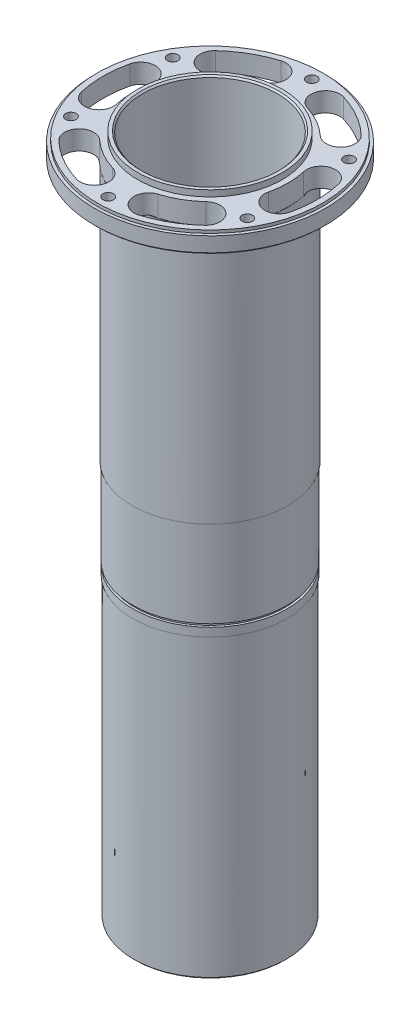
ISO-10303-21;
HEADER;
FILE_DESCRIPTION(('STEP AP214'),'2;1');
FILE_NAME('part.step','',(''),(''),'','','');
FILE_SCHEMA(('AUTOMOTIVE_DESIGN { 1 0 10303 214 1 1 1 1 }'));
ENDSEC;
DATA;
#1=APPLICATION_CONTEXT('core data for automotive mechanical design processes');
#2=APPLICATION_PROTOCOL_DEFINITION('international standard','automotive_design',2000,#1);
#3=PRODUCT_CONTEXT('',#1,'mechanical');
#4=PRODUCT('Part','Part','',(#3));
#5=PRODUCT_RELATED_PRODUCT_CATEGORY('part','',(#4));
#6=PRODUCT_DEFINITION_FORMATION('','',#4);
#7=PRODUCT_DEFINITION_CONTEXT('part definition',#1,'design');
#8=PRODUCT_DEFINITION('design','',#6,#7);
#9=PRODUCT_DEFINITION_SHAPE('','',#8);
#10=(LENGTH_UNIT() NAMED_UNIT(*) SI_UNIT(.MILLI.,.METRE.));
#11=(NAMED_UNIT(*) PLANE_ANGLE_UNIT() SI_UNIT($,.RADIAN.));
#12=(NAMED_UNIT(*) SI_UNIT($,.STERADIAN.) SOLID_ANGLE_UNIT());
#13=UNCERTAINTY_MEASURE_WITH_UNIT(LENGTH_MEASURE(1.E-05),#10,'distance_accuracy_value','');
#14=(GEOMETRIC_REPRESENTATION_CONTEXT(3) GLOBAL_UNCERTAINTY_ASSIGNED_CONTEXT((#13)) GLOBAL_UNIT_ASSIGNED_CONTEXT((#10,
#11,#12)) REPRESENTATION_CONTEXT('',''));
#15=CARTESIAN_POINT('',(0.,0.,0.));
#16=DIRECTION('',(0.,0.,1.));
#17=DIRECTION('',(1.,0.,0.));
#18=AXIS2_PLACEMENT_3D('',#15,#16,#17);
#19=CARTESIAN_POINT('',(-23.8125,0.,0.));
#20=DIRECTION('',(0.,-1.,0.));
#21=DIRECTION('',(0.,0.,-1.));
#22=AXIS2_PLACEMENT_3D('',#19,#20,#21);
#23=PLANE('',#22);
#24=CARTESIAN_POINT('',(29.6987995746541,0.,-6.85650813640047));
#25=DIRECTION('',(0.,1.,0.));
#26=DIRECTION('',(0.866025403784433,0.,0.50000000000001));
#27=AXIS2_PLACEMENT_3D('',#24,#25,#26);
#28=CIRCLE('',#27,4.7752);
#29=CARTESIAN_POINT('',(34.3516115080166,0.,-7.93069441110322));
#30=VERTEX_POINT('',#29);
#31=CARTESIAN_POINT('',(25.0459876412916,0.,-5.78232186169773));
#32=VERTEX_POINT('',#31);
#33=EDGE_CURVE('E703',#30,#32,#28,.T.);
#34=ORIENTED_EDGE('',*,*,#33,.F.);
#35=CARTESIAN_POINT('',(0.,0.,0.));
#36=DIRECTION('',(0.,1.,0.));
#37=DIRECTION('',(0.866025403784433,0.,0.50000000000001));
#38=AXIS2_PLACEMENT_3D('',#35,#36,#37);
#39=CIRCLE('',#38,35.2552);
#40=CARTESIAN_POINT('',(34.3516115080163,0.,7.93069441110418));
#41=VERTEX_POINT('',#40);
#42=EDGE_CURVE('E52',#41,#30,#39,.T.);
#43=ORIENTED_EDGE('',*,*,#42,.F.);
#44=CARTESIAN_POINT('',(29.6987995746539,0.,6.85650813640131));
#45=DIRECTION('',(0.,1.,0.));
#46=DIRECTION('',(0.866025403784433,0.,0.50000000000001));
#47=AXIS2_PLACEMENT_3D('',#44,#45,#46);
#48=CIRCLE('',#47,4.7752);
#49=CARTESIAN_POINT('',(25.0459876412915,0.,5.78232186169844));
#50=VERTEX_POINT('',#49);
#51=EDGE_CURVE('E712',#50,#41,#48,.T.);
#52=ORIENTED_EDGE('',*,*,#51,.F.);
#53=CARTESIAN_POINT('',(0.,0.,0.));
#54=DIRECTION('',(0.,-1.,0.));
#55=DIRECTION('',(0.866025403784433,0.,0.50000000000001));
#56=AXIS2_PLACEMENT_3D('',#53,#54,#55);
#57=CIRCLE('',#56,25.7048);
#58=EDGE_CURVE('E709',#32,#50,#57,.T.);
#59=ORIENTED_EDGE('',*,*,#58,.F.);
#60=EDGE_LOOP('',(#34,#43,#52,#59));
#61=FACE_BOUND('',#60,.T.);
#62=CARTESIAN_POINT('',(8.91148955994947,0.,-29.1481689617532));
#63=DIRECTION('',(0.,1.,0.));
#64=DIRECTION('',(0.866025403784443,0.,-0.499999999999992));
#65=AXIS2_PLACEMENT_3D('',#62,#63,#64);
#66=CIRCLE('',#65,4.7752);
#67=CARTESIAN_POINT('',(10.3076229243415,0.,-33.7147154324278));
#68=VERTEX_POINT('',#67);
#69=CARTESIAN_POINT('',(7.51535619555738,0.,-24.5816224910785));
#70=VERTEX_POINT('',#69);
#71=EDGE_CURVE('E777',#68,#70,#66,.T.);
#72=ORIENTED_EDGE('',*,*,#71,.F.);
#73=CARTESIAN_POINT('',(0.,0.,0.));
#74=DIRECTION('',(0.,1.,0.));
#75=DIRECTION('',(0.866025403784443,0.,-0.499999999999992));
#76=AXIS2_PLACEMENT_3D('',#73,#74,#75);
#77=CIRCLE('',#76,35.2552);
#78=CARTESIAN_POINT('',(24.0439885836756,0.,-25.784021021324));
#79=VERTEX_POINT('',#78);
#80=EDGE_CURVE('E775',#79,#68,#77,.T.);
#81=ORIENTED_EDGE('',*,*,#80,.F.);
#82=CARTESIAN_POINT('',(20.7873100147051,0.,-22.2916608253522));
#83=DIRECTION('',(0.,1.,0.));
#84=DIRECTION('',(0.866025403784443,0.,-0.499999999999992));
#85=AXIS2_PLACEMENT_3D('',#82,#83,#84);
#86=CIRCLE('',#85,4.7752);
#87=CARTESIAN_POINT('',(17.5306314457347,0.,-18.7993006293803));
#88=VERTEX_POINT('',#87);
#89=EDGE_CURVE('E783',#88,#79,#86,.T.);
#90=ORIENTED_EDGE('',*,*,#89,.F.);
#91=CARTESIAN_POINT('',(0.,0.,0.));
#92=DIRECTION('',(0.,-1.,0.));
#93=DIRECTION('',(0.866025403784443,0.,-0.499999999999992));
#94=AXIS2_PLACEMENT_3D('',#91,#92,#93);
#95=CIRCLE('',#94,25.7048);
#96=EDGE_CURVE('E780',#70,#88,#95,.T.);
#97=ORIENTED_EDGE('',*,*,#96,.F.);
#98=EDGE_LOOP('',(#72,#81,#90,#97));
#99=FACE_BOUND('',#98,.T.);
#100=CARTESIAN_POINT('',(-20.7873100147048,0.,-22.2916608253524));
#101=DIRECTION('',(0.,1.,0.));
#102=DIRECTION('',(0.,0.,-1.));
#103=AXIS2_PLACEMENT_3D('',#100,#101,#102);
#104=CIRCLE('',#103,4.7752);
#105=CARTESIAN_POINT('',(-24.0439885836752,0.,-25.7840210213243));
#106=VERTEX_POINT('',#105);
#107=CARTESIAN_POINT('',(-17.5306314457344,0.,-18.7993006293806));
#108=VERTEX_POINT('',#107);
#109=EDGE_CURVE('E856',#106,#108,#104,.T.);
#110=ORIENTED_EDGE('',*,*,#109,.F.);
#111=CARTESIAN_POINT('',(0.,0.,0.));
#112=DIRECTION('',(0.,1.,0.));
#113=DIRECTION('',(0.,0.,-1.));
#114=AXIS2_PLACEMENT_3D('',#111,#112,#113);
#115=CIRCLE('',#114,35.2552);
#116=CARTESIAN_POINT('',(-10.3076229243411,0.,-33.714715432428));
#117=VERTEX_POINT('',#116);
#118=EDGE_CURVE('E867',#117,#106,#115,.T.);
#119=ORIENTED_EDGE('',*,*,#118,.F.);
#120=CARTESIAN_POINT('',(-8.91148955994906,0.,-29.1481689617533));
#121=DIRECTION('',(0.,1.,0.));
#122=DIRECTION('',(0.,0.,-1.));
#123=AXIS2_PLACEMENT_3D('',#120,#121,#122);
#124=CIRCLE('',#123,4.7752);
#125=CARTESIAN_POINT('',(-7.51535619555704,0.,-24.5816224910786));
#126=VERTEX_POINT('',#125);
#127=EDGE_CURVE('E859',#126,#117,#124,.T.);
#128=ORIENTED_EDGE('',*,*,#127,.F.);
#129=CARTESIAN_POINT('',(0.,0.,0.));
#130=DIRECTION('',(0.,-1.,0.));
#131=DIRECTION('',(0.,0.,-1.));
#132=AXIS2_PLACEMENT_3D('',#129,#130,#131);
#133=CIRCLE('',#132,25.7048);
#134=EDGE_CURVE('E864',#108,#126,#133,.T.);
#135=ORIENTED_EDGE('',*,*,#134,.F.);
#136=EDGE_LOOP('',(#110,#119,#128,#135));
#137=FACE_BOUND('',#136,.T.);
#138=CARTESIAN_POINT('',(-29.698799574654,0.,6.85650813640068));
#139=DIRECTION('',(0.,1.,0.));
#140=DIRECTION('',(-0.866025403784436,0.,-0.500000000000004));
#141=AXIS2_PLACEMENT_3D('',#138,#139,#140);
#142=CIRCLE('',#141,4.7752);
#143=CARTESIAN_POINT('',(-34.3516115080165,0.,7.93069441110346));
#144=VERTEX_POINT('',#143);
#145=CARTESIAN_POINT('',(-25.0459876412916,0.,5.78232186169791));
#146=VERTEX_POINT('',#145);
#147=EDGE_CURVE('E1260',#144,#146,#142,.T.);
#148=ORIENTED_EDGE('',*,*,#147,.F.);
#149=CARTESIAN_POINT('',(0.,0.,0.));
#150=DIRECTION('',(0.,1.,0.));
#151=DIRECTION('',(-0.866025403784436,0.,-0.500000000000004));
#152=AXIS2_PLACEMENT_3D('',#149,#150,#151);
#153=CIRCLE('',#152,35.2552);
#154=CARTESIAN_POINT('',(-34.3516115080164,0.,-7.93069441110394));
#155=VERTEX_POINT('',#154);
#156=EDGE_CURVE('E416',#155,#144,#153,.T.);
#157=ORIENTED_EDGE('',*,*,#156,.F.);
#158=CARTESIAN_POINT('',(-29.698799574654,0.,-6.8565081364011));
#159=DIRECTION('',(0.,1.,0.));
#160=DIRECTION('',(-0.866025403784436,0.,-0.500000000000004));
#161=AXIS2_PLACEMENT_3D('',#158,#159,#160);
#162=CIRCLE('',#161,4.7752);
#163=CARTESIAN_POINT('',(-25.0459876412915,0.,-5.78232186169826));
#164=VERTEX_POINT('',#163);
#165=EDGE_CURVE('E1254',#164,#155,#162,.T.);
#166=ORIENTED_EDGE('',*,*,#165,.F.);
#167=CARTESIAN_POINT('',(0.,0.,0.));
#168=DIRECTION('',(0.,-1.,0.));
#169=DIRECTION('',(-0.866025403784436,0.,-0.500000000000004));
#170=AXIS2_PLACEMENT_3D('',#167,#168,#169);
#171=CIRCLE('',#170,25.7048);
#172=EDGE_CURVE('E1256',#146,#164,#171,.T.);
#173=ORIENTED_EDGE('',*,*,#172,.F.);
#174=EDGE_LOOP('',(#148,#157,#166,#173));
#175=FACE_BOUND('',#174,.T.);
#176=CARTESIAN_POINT('',(-8.91148955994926,0.,29.1481689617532));
#177=DIRECTION('',(0.,1.,0.));
#178=DIRECTION('',(-0.86602540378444,0.,0.499999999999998));
#179=AXIS2_PLACEMENT_3D('',#176,#177,#178);
#180=CIRCLE('',#179,4.7752);
#181=CARTESIAN_POINT('',(-10.3076229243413,0.,33.7147154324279));
#182=VERTEX_POINT('',#181);
#183=CARTESIAN_POINT('',(-7.51535619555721,0.,24.5816224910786));
#184=VERTEX_POINT('',#183);
#185=EDGE_CURVE('E489',#182,#184,#180,.T.);
#186=ORIENTED_EDGE('',*,*,#185,.F.);
#187=CARTESIAN_POINT('',(0.,0.,0.));
#188=DIRECTION('',(0.,1.,0.));
#189=DIRECTION('',(-0.86602540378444,0.,0.499999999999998));
#190=AXIS2_PLACEMENT_3D('',#187,#188,#189);
#191=CIRCLE('',#190,35.2552);
#192=CARTESIAN_POINT('',(-24.0439885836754,0.,25.7840210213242));
#193=VERTEX_POINT('',#192);
#194=EDGE_CURVE('E487',#193,#182,#191,.T.);
#195=ORIENTED_EDGE('',*,*,#194,.F.);
#196=CARTESIAN_POINT('',(-20.787310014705,0.,22.2916608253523));
#197=DIRECTION('',(0.,1.,0.));
#198=DIRECTION('',(-0.86602540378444,0.,0.499999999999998));
#199=AXIS2_PLACEMENT_3D('',#196,#197,#198);
#200=CIRCLE('',#199,4.7752);
#201=CARTESIAN_POINT('',(-17.5306314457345,0.,18.7993006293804));
#202=VERTEX_POINT('',#201);
#203=EDGE_CURVE('E495',#202,#193,#200,.T.);
#204=ORIENTED_EDGE('',*,*,#203,.F.);
#205=CARTESIAN_POINT('',(0.,0.,0.));
#206=DIRECTION('',(0.,-1.,0.));
#207=DIRECTION('',(-0.86602540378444,0.,0.499999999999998));
#208=AXIS2_PLACEMENT_3D('',#205,#206,#207);
#209=CIRCLE('',#208,25.7048);
#210=EDGE_CURVE('E492',#184,#202,#209,.T.);
#211=ORIENTED_EDGE('',*,*,#210,.F.);
#212=EDGE_LOOP('',(#186,#195,#204,#211));
#213=FACE_BOUND('',#212,.T.);
#214=CARTESIAN_POINT('',(4.70110061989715E-13,0.,-33.528));
#215=DIRECTION('',(0.,1.,0.));
#216=DIRECTION('',(0.,0.,1.));
#217=AXIS2_PLACEMENT_3D('',#214,#215,#216);
#218=CIRCLE('',#217,1.7272);
#219=CARTESIAN_POINT('',(4.70110061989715E-13,0.,-31.8008));
#220=VERTEX_POINT('',#219);
#221=EDGE_CURVE('E530',#220,#220,#218,.T.);
#222=ORIENTED_EDGE('',*,*,#221,.F.);
#223=EDGE_LOOP('',(#222));
#224=FACE_BOUND('',#223,.T.);
#225=CARTESIAN_POINT('',(-29.0360997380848,0.,16.7639999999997));
#226=DIRECTION('',(0.,1.,0.));
#227=DIRECTION('',(0.,0.,1.));
#228=AXIS2_PLACEMENT_3D('',#225,#226,#227);
#229=CIRCLE('',#228,1.7272);
#230=CARTESIAN_POINT('',(-29.0360997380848,0.,18.4911999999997));
#231=VERTEX_POINT('',#230);
#232=EDGE_CURVE('E281',#231,#231,#229,.T.);
#233=ORIENTED_EDGE('',*,*,#232,.F.);
#234=EDGE_LOOP('',(#233));
#235=FACE_BOUND('',#234,.T.);
#236=CARTESIAN_POINT('',(-2.34187669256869E-13,0.,33.528));
#237=DIRECTION('',(0.,1.,0.));
#238=DIRECTION('',(0.,0.,1.));
#239=AXIS2_PLACEMENT_3D('',#236,#237,#238);
#240=CIRCLE('',#239,1.7272);
#241=CARTESIAN_POINT('',(-2.34187669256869E-13,0.,35.2552));
#242=VERTEX_POINT('',#241);
#243=EDGE_CURVE('E277',#242,#242,#240,.T.);
#244=ORIENTED_EDGE('',*,*,#243,.F.);
#245=EDGE_LOOP('',(#244));
#246=FACE_BOUND('',#245,.T.);
#247=CARTESIAN_POINT('',(20.7873100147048,0.,22.2916608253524));
#248=DIRECTION('',(0.,1.,0.));
#249=DIRECTION('',(0.,0.,1.));
#250=AXIS2_PLACEMENT_3D('',#247,#248,#249);
#251=CIRCLE('',#250,4.7752);
#252=CARTESIAN_POINT('',(24.0439885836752,0.,25.7840210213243));
#253=VERTEX_POINT('',#252);
#254=CARTESIAN_POINT('',(17.5306314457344,0.,18.7993006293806));
#255=VERTEX_POINT('',#254);
#256=EDGE_CURVE('E677',#253,#255,#251,.T.);
#257=ORIENTED_EDGE('',*,*,#256,.F.);
#258=CARTESIAN_POINT('',(0.,0.,0.));
#259=DIRECTION('',(0.,1.,0.));
#260=DIRECTION('',(0.,0.,1.));
#261=AXIS2_PLACEMENT_3D('',#258,#259,#260);
#262=CIRCLE('',#261,35.2552);
#263=CARTESIAN_POINT('',(10.3076229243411,0.,33.714715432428));
#264=VERTEX_POINT('',#263);
#265=EDGE_CURVE('E675',#264,#253,#262,.T.);
#266=ORIENTED_EDGE('',*,*,#265,.F.);
#267=CARTESIAN_POINT('',(8.91148955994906,0.,29.1481689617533));
#268=DIRECTION('',(0.,1.,0.));
#269=DIRECTION('',(0.,0.,1.));
#270=AXIS2_PLACEMENT_3D('',#267,#268,#269);
#271=CIRCLE('',#270,4.7752);
#272=CARTESIAN_POINT('',(7.51535619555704,0.,24.5816224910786));
#273=VERTEX_POINT('',#272);
#274=EDGE_CURVE('E684',#273,#264,#271,.T.);
#275=ORIENTED_EDGE('',*,*,#274,.F.);
#276=CARTESIAN_POINT('',(0.,0.,0.));
#277=DIRECTION('',(0.,-1.,0.));
#278=DIRECTION('',(0.,0.,1.));
#279=AXIS2_PLACEMENT_3D('',#276,#277,#278);
#280=CIRCLE('',#279,25.7048);
#281=EDGE_CURVE('E681',#255,#273,#280,.T.);
#282=ORIENTED_EDGE('',*,*,#281,.F.);
#283=EDGE_LOOP('',(#257,#266,#275,#282));
#284=FACE_BOUND('',#283,.T.);
#285=CARTESIAN_POINT('',(29.0360997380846,0.,16.7640000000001));
#286=DIRECTION('',(0.,1.,0.));
#287=DIRECTION('',(0.,0.,1.));
#288=AXIS2_PLACEMENT_3D('',#285,#286,#287);
#289=CIRCLE('',#288,1.7272);
#290=CARTESIAN_POINT('',(29.0360997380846,0.,18.4912000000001));
#291=VERTEX_POINT('',#290);
#292=EDGE_CURVE('E661',#291,#291,#289,.T.);
#293=ORIENTED_EDGE('',*,*,#292,.F.);
#294=EDGE_LOOP('',(#293));
#295=FACE_BOUND('',#294,.T.);
#296=CARTESIAN_POINT('',(0.,0.,0.));
#297=DIRECTION('',(0.,-1.,0.));
#298=DIRECTION('',(0.,0.,-1.));
#299=AXIS2_PLACEMENT_3D('',#296,#297,#298);
#300=CIRCLE('',#299,37.1348);
#301=CARTESIAN_POINT('',(0.,0.,-37.1348));
#302=VERTEX_POINT('',#301);
#303=EDGE_CURVE('E376',#302,#302,#300,.T.);
#304=ORIENTED_EDGE('',*,*,#303,.F.);
#305=EDGE_LOOP('',(#304));
#306=FACE_BOUND('',#305,.T.);
#307=CARTESIAN_POINT('',(0.,0.,0.));
#308=DIRECTION('',(0.,-1.,0.));
#309=DIRECTION('',(0.,0.,-1.));
#310=AXIS2_PLACEMENT_3D('',#307,#308,#309);
#311=CIRCLE('',#310,23.8125);
#312=CARTESIAN_POINT('',(0.,0.,-23.8125));
#313=VERTEX_POINT('',#312);
#314=EDGE_CURVE('E372',#313,#313,#311,.T.);
#315=ORIENTED_EDGE('',*,*,#314,.T.);
#316=EDGE_LOOP('',(#315));
#317=FACE_BOUND('',#316,.T.);
#318=CARTESIAN_POINT('',(-29.0360997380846,0.,-16.7640000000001));
#319=DIRECTION('',(0.,1.,0.));
#320=DIRECTION('',(0.,0.,1.));
#321=AXIS2_PLACEMENT_3D('',#318,#319,#320);
#322=CIRCLE('',#321,1.7272);
#323=CARTESIAN_POINT('',(-29.0360997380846,0.,-15.0368000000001));
#324=VERTEX_POINT('',#323);
#325=EDGE_CURVE('E536',#324,#324,#322,.T.);
#326=ORIENTED_EDGE('',*,*,#325,.F.);
#327=EDGE_LOOP('',(#326));
#328=FACE_BOUND('',#327,.T.);
#329=CARTESIAN_POINT('',(29.0360997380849,0.,-16.7639999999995));
#330=DIRECTION('',(0.,1.,0.));
#331=DIRECTION('',(0.,0.,1.));
#332=AXIS2_PLACEMENT_3D('',#329,#330,#331);
#333=CIRCLE('',#332,1.7272);
#334=CARTESIAN_POINT('',(29.0360997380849,0.,-15.0367999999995));
#335=VERTEX_POINT('',#334);
#336=EDGE_CURVE('E523',#335,#335,#333,.T.);
#337=ORIENTED_EDGE('',*,*,#336,.F.);
#338=EDGE_LOOP('',(#337));
#339=FACE_BOUND('',#338,.T.);
#340=ADVANCED_FACE('F37',(#61,#99,#137,#175,#213,#224,#235,#246,#284,#295,#306,#317,#328,#339),
#23,.F.);
#341=CARTESIAN_POINT('',(0.,0.,0.));
#342=DIRECTION('',(0.,-1.,0.));
#343=DIRECTION('',(0.,0.,-1.));
#344=AXIS2_PLACEMENT_3D('',#341,#342,#343);
#345=CYLINDRICAL_SURFACE('',#344,37.1348);
#346=CARTESIAN_POINT('',(0.,-0.990600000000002,0.));
#347=DIRECTION('',(0.,-1.,0.));
#348=DIRECTION('',(0.,0.,-1.));
#349=AXIS2_PLACEMENT_3D('',#346,#347,#348);
#350=CIRCLE('',#349,37.1348);
#351=CARTESIAN_POINT('',(0.,-0.990600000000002,-37.1348));
#352=VERTEX_POINT('',#351);
#353=EDGE_CURVE('E656',#352,#352,#350,.T.);
#354=ORIENTED_EDGE('',*,*,#353,.F.);
#355=EDGE_LOOP('',(#354));
#356=FACE_BOUND('',#355,.T.);
#357=ORIENTED_EDGE('',*,*,#303,.T.);
#358=EDGE_LOOP('',(#357));
#359=FACE_BOUND('',#358,.T.);
#360=ADVANCED_FACE('F313',(#356,#359),#345,.T.);
#361=CARTESIAN_POINT('',(0.,0.,0.));
#362=DIRECTION('',(0.,-1.,0.));
#363=DIRECTION('',(0.,0.,-1.));
#364=AXIS2_PLACEMENT_3D('',#361,#362,#363);
#365=CYLINDRICAL_SURFACE('',#364,23.8125);
#366=ORIENTED_EDGE('',*,*,#314,.F.);
#367=EDGE_LOOP('',(#366));
#368=FACE_BOUND('',#367,.T.);
#369=CARTESIAN_POINT('',(0.,2.032,0.));
#370=DIRECTION('',(0.,-1.,0.));
#371=DIRECTION('',(0.,0.,-1.));
#372=AXIS2_PLACEMENT_3D('',#369,#370,#371);
#373=CIRCLE('',#372,23.8125);
#374=CARTESIAN_POINT('',(0.,2.032,-23.8125));
#375=VERTEX_POINT('',#374);
#376=EDGE_CURVE('E370',#375,#375,#373,.T.);
#377=ORIENTED_EDGE('',*,*,#376,.T.);
#378=EDGE_LOOP('',(#377));
#379=FACE_BOUND('',#378,.T.);
#380=ADVANCED_FACE('F319',(#368,#379),#365,.T.);
#381=CARTESIAN_POINT('',(-23.8125,2.032,0.));
#382=DIRECTION('',(0.,-1.,0.));
#383=DIRECTION('',(0.,0.,-1.));
#384=AXIS2_PLACEMENT_3D('',#381,#382,#383);
#385=PLANE('',#384);
#386=CARTESIAN_POINT('',(0.,2.032,0.));
#387=DIRECTION('',(0.,-1.,0.));
#388=DIRECTION('',(0.,0.,-1.));
#389=AXIS2_PLACEMENT_3D('',#386,#387,#388);
#390=CIRCLE('',#389,22.733);
#391=CARTESIAN_POINT('',(0.,2.032,-22.733));
#392=VERTEX_POINT('',#391);
#393=EDGE_CURVE('E296',#392,#392,#390,.T.);
#394=ORIENTED_EDGE('',*,*,#393,.T.);
#395=EDGE_LOOP('',(#394));
#396=FACE_BOUND('',#395,.T.);
#397=ORIENTED_EDGE('',*,*,#376,.F.);
#398=EDGE_LOOP('',(#397));
#399=FACE_BOUND('',#398,.T.);
#400=ADVANCED_FACE('F356',(#396,#399),#385,.F.);
#401=CARTESIAN_POINT('',(0.,0.,0.));
#402=DIRECTION('',(0.,-1.,0.));
#403=DIRECTION('',(0.,0.,-1.));
#404=AXIS2_PLACEMENT_3D('',#401,#402,#403);
#405=CYLINDRICAL_SURFACE('',#404,22.225);
#406=CARTESIAN_POINT('',(0.,-221.742,0.));
#407=DIRECTION('',(0.,1.,0.));
#408=DIRECTION('',(0.,0.,1.));
#409=AXIS2_PLACEMENT_3D('',#406,#407,#408);
#410=CIRCLE('',#409,22.225);
#411=CARTESIAN_POINT('',(0.,-221.742,22.225));
#412=VERTEX_POINT('',#411);
#413=EDGE_CURVE('E284',#412,#412,#410,.F.);
#414=ORIENTED_EDGE('',*,*,#413,.T.);
#415=EDGE_LOOP('',(#414));
#416=FACE_BOUND('',#415,.T.);
#417=CARTESIAN_POINT('',(0.,1.52399999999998,0.));
#418=DIRECTION('',(0.,-1.,0.));
#419=DIRECTION('',(0.,0.,-1.));
#420=AXIS2_PLACEMENT_3D('',#417,#418,#419);
#421=CIRCLE('',#420,22.225);
#422=CARTESIAN_POINT('',(0.,1.52399999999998,-22.225));
#423=VERTEX_POINT('',#422);
#424=EDGE_CURVE('E266',#423,#423,#421,.F.);
#425=ORIENTED_EDGE('',*,*,#424,.T.);
#426=EDGE_LOOP('',(#425));
#427=FACE_BOUND('',#426,.T.);
#428=ADVANCED_FACE('F346',(#416,#427),#405,.F.);
#429=CARTESIAN_POINT('',(-22.225,-222.25,0.));
#430=DIRECTION('',(0.,1.,0.));
#431=DIRECTION('',(0.,0.,1.));
#432=AXIS2_PLACEMENT_3D('',#429,#430,#431);
#433=PLANE('',#432);
#434=CARTESIAN_POINT('',(0.,-222.25,0.));
#435=DIRECTION('',(0.,1.,0.));
#436=DIRECTION('',(0.,0.,1.));
#437=AXIS2_PLACEMENT_3D('',#434,#435,#436);
#438=CIRCLE('',#437,22.733);
#439=CARTESIAN_POINT('',(0.,-222.25,22.733));
#440=VERTEX_POINT('',#439);
#441=EDGE_CURVE('E290',#440,#440,#438,.T.);
#442=ORIENTED_EDGE('',*,*,#441,.T.);
#443=EDGE_LOOP('',(#442));
#444=FACE_BOUND('',#443,.T.);
#445=CARTESIAN_POINT('',(0.,-222.25,0.));
#446=DIRECTION('',(0.,1.,0.));
#447=DIRECTION('',(0.,0.,1.));
#448=AXIS2_PLACEMENT_3D('',#445,#446,#447);
#449=CIRCLE('',#448,24.638);
#450=CARTESIAN_POINT('',(0.,-222.25,24.638));
#451=VERTEX_POINT('',#450);
#452=EDGE_CURVE('E287',#451,#451,#449,.F.);
#453=ORIENTED_EDGE('',*,*,#452,.T.);
#454=EDGE_LOOP('',(#453));
#455=FACE_BOUND('',#454,.T.);
#456=ADVANCED_FACE('F343',(#444,#455),#433,.F.);
#457=CARTESIAN_POINT('',(0.,0.,0.));
#458=DIRECTION('',(0.,-1.,0.));
#459=DIRECTION('',(0.,0.,-1.));
#460=AXIS2_PLACEMENT_3D('',#457,#458,#459);
#461=CYLINDRICAL_SURFACE('',#460,25.146);
#462=CARTESIAN_POINT('',(0.,-221.742,0.));
#463=DIRECTION('',(0.,1.,0.));
#464=DIRECTION('',(0.,0.,1.));
#465=AXIS2_PLACEMENT_3D('',#462,#463,#464);
#466=CIRCLE('',#465,25.146);
#467=CARTESIAN_POINT('',(0.,-221.742,25.146));
#468=VERTEX_POINT('',#467);
#469=EDGE_CURVE('E293',#468,#468,#466,.T.);
#470=ORIENTED_EDGE('',*,*,#469,.T.);
#471=EDGE_LOOP('',(#470));
#472=FACE_BOUND('',#471,.T.);
#473=CARTESIAN_POINT('',(0.,-124.46,0.));
#474=DIRECTION('',(0.,-1.,0.));
#475=DIRECTION('',(0.,0.,-1.));
#476=AXIS2_PLACEMENT_3D('',#473,#474,#475);
#477=CIRCLE('',#476,25.146);
#478=CARTESIAN_POINT('',(0.,-124.46,-25.146));
#479=VERTEX_POINT('',#478);
#480=EDGE_CURVE('E373',#479,#479,#477,.T.);
#481=ORIENTED_EDGE('',*,*,#480,.T.);
#482=EDGE_LOOP('',(#481));
#483=FACE_BOUND('',#482,.T.);
#484=ADVANCED_FACE('F345',(#472,#483),#461,.T.);
#485=CARTESIAN_POINT('',(-25.146,-124.46,0.));
#486=DIRECTION('',(0.,1.,0.));
#487=DIRECTION('',(0.,0.,1.));
#488=AXIS2_PLACEMENT_3D('',#485,#486,#487);
#489=PLANE('',#488);
#490=ORIENTED_EDGE('',*,*,#480,.F.);
#491=EDGE_LOOP('',(#490));
#492=FACE_BOUND('',#491,.T.);
#493=CARTESIAN_POINT('',(0.,-124.46,0.));
#494=DIRECTION('',(0.,-1.,0.));
#495=DIRECTION('',(0.,0.,-1.));
#496=AXIS2_PLACEMENT_3D('',#493,#494,#495);
#497=CIRCLE('',#496,25.4);
#498=CARTESIAN_POINT('',(0.,-124.46,-25.4));
#499=VERTEX_POINT('',#498);
#500=EDGE_CURVE('E379',#499,#499,#497,.T.);
#501=ORIENTED_EDGE('',*,*,#500,.T.);
#502=EDGE_LOOP('',(#501));
#503=FACE_BOUND('',#502,.T.);
#504=ADVANCED_FACE('F353',(#492,#503),#489,.F.);
#505=CARTESIAN_POINT('',(0.,0.,0.));
#506=DIRECTION('',(0.,-1.,0.));
#507=DIRECTION('',(0.,0.,-1.));
#508=AXIS2_PLACEMENT_3D('',#505,#506,#507);
#509=CYLINDRICAL_SURFACE('',#508,25.4);
#510=ORIENTED_EDGE('',*,*,#500,.F.);
#511=EDGE_LOOP('',(#510));
#512=FACE_BOUND('',#511,.T.);
#513=CARTESIAN_POINT('',(0.,-121.6406,0.));
#514=DIRECTION('',(0.,-1.,0.));
#515=DIRECTION('',(0.,0.,-1.));
#516=AXIS2_PLACEMENT_3D('',#513,#514,#515);
#517=CIRCLE('',#516,25.4);
#518=CARTESIAN_POINT('',(0.,-121.6406,-25.4));
#519=VERTEX_POINT('',#518);
#520=EDGE_CURVE('E634',#519,#519,#517,.T.);
#521=ORIENTED_EDGE('',*,*,#520,.T.);
#522=EDGE_LOOP('',(#521));
#523=FACE_BOUND('',#522,.T.);
#524=ADVANCED_FACE('F622',(#512,#523),#509,.T.);
#525=CARTESIAN_POINT('',(-25.4,-121.6406,0.));
#526=DIRECTION('',(0.,-1.,0.));
#527=DIRECTION('',(0.,0.,-1.));
#528=AXIS2_PLACEMENT_3D('',#525,#526,#527);
#529=PLANE('',#528);
#530=ORIENTED_EDGE('',*,*,#520,.F.);
#531=EDGE_LOOP('',(#530));
#532=FACE_BOUND('',#531,.T.);
#533=CARTESIAN_POINT('',(0.,-121.6406,0.));
#534=DIRECTION('',(0.,-1.,0.));
#535=DIRECTION('',(0.,0.,-1.));
#536=AXIS2_PLACEMENT_3D('',#533,#534,#535);
#537=CIRCLE('',#536,24.6761);
#538=CARTESIAN_POINT('',(0.,-121.6406,-24.6761));
#539=VERTEX_POINT('',#538);
#540=EDGE_CURVE('E636',#539,#539,#537,.T.);
#541=ORIENTED_EDGE('',*,*,#540,.T.);
#542=EDGE_LOOP('',(#541));
#543=FACE_BOUND('',#542,.T.);
#544=ADVANCED_FACE('F618',(#532,#543),#529,.F.);
#545=CARTESIAN_POINT('',(0.,0.,0.));
#546=DIRECTION('',(0.,-1.,0.));
#547=DIRECTION('',(0.,0.,-1.));
#548=AXIS2_PLACEMENT_3D('',#545,#546,#547);
#549=CYLINDRICAL_SURFACE('',#548,24.6761);
#550=ORIENTED_EDGE('',*,*,#540,.F.);
#551=EDGE_LOOP('',(#550));
#552=FACE_BOUND('',#551,.T.);
#553=CARTESIAN_POINT('',(0.,-120.65,0.));
#554=DIRECTION('',(0.,-1.,0.));
#555=DIRECTION('',(0.,0.,-1.));
#556=AXIS2_PLACEMENT_3D('',#553,#554,#555);
#557=CIRCLE('',#556,24.6761);
#558=CARTESIAN_POINT('',(0.,-120.65,-24.6761));
#559=VERTEX_POINT('',#558);
#560=EDGE_CURVE('E641',#559,#559,#557,.T.);
#561=ORIENTED_EDGE('',*,*,#560,.T.);
#562=EDGE_LOOP('',(#561));
#563=FACE_BOUND('',#562,.T.);
#564=ADVANCED_FACE('F614',(#552,#563),#549,.T.);
#565=CARTESIAN_POINT('',(-24.6761,-120.65,0.));
#566=DIRECTION('',(0.,1.,0.));
#567=DIRECTION('',(0.,0.,1.));
#568=AXIS2_PLACEMENT_3D('',#565,#566,#567);
#569=PLANE('',#568);
#570=ORIENTED_EDGE('',*,*,#560,.F.);
#571=EDGE_LOOP('',(#570));
#572=FACE_BOUND('',#571,.T.);
#573=CARTESIAN_POINT('',(0.,-120.65,0.));
#574=DIRECTION('',(0.,-1.,0.));
#575=DIRECTION('',(0.,0.,-1.));
#576=AXIS2_PLACEMENT_3D('',#573,#574,#575);
#577=CIRCLE('',#576,25.4);
#578=CARTESIAN_POINT('',(0.,-120.65,-25.4));
#579=VERTEX_POINT('',#578);
#580=EDGE_CURVE('E644',#579,#579,#577,.T.);
#581=ORIENTED_EDGE('',*,*,#580,.T.);
#582=EDGE_LOOP('',(#581));
#583=FACE_BOUND('',#582,.T.);
#584=ADVANCED_FACE('F610',(#572,#583),#569,.F.);
#585=CARTESIAN_POINT('',(0.,0.,0.));
#586=DIRECTION('',(0.,-1.,0.));
#587=DIRECTION('',(0.,0.,-1.));
#588=AXIS2_PLACEMENT_3D('',#585,#586,#587);
#589=CYLINDRICAL_SURFACE('',#588,25.4);
#590=ORIENTED_EDGE('',*,*,#580,.F.);
#591=EDGE_LOOP('',(#590));
#592=FACE_BOUND('',#591,.T.);
#593=CARTESIAN_POINT('',(0.,-92.0749999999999,0.));
#594=DIRECTION('',(0.,-1.,0.));
#595=DIRECTION('',(0.,0.,-1.));
#596=AXIS2_PLACEMENT_3D('',#593,#594,#595);
#597=CIRCLE('',#596,25.4);
#598=CARTESIAN_POINT('',(0.,-92.0749999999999,-25.4));
#599=VERTEX_POINT('',#598);
#600=EDGE_CURVE('E647',#599,#599,#597,.T.);
#601=ORIENTED_EDGE('',*,*,#600,.T.);
#602=EDGE_LOOP('',(#601));
#603=FACE_BOUND('',#602,.T.);
#604=ADVANCED_FACE('F606',(#592,#603),#589,.T.);
#605=CARTESIAN_POINT('',(-25.4,-92.0749999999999,0.));
#606=DIRECTION('',(0.,1.,0.));
#607=DIRECTION('',(0.,0.,1.));
#608=AXIS2_PLACEMENT_3D('',#605,#606,#607);
#609=PLANE('',#608);
#610=ORIENTED_EDGE('',*,*,#600,.F.);
#611=EDGE_LOOP('',(#610));
#612=FACE_BOUND('',#611,.T.);
#613=CARTESIAN_POINT('',(0.,-92.0749999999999,0.));
#614=DIRECTION('',(0.,-1.,0.));
#615=DIRECTION('',(0.,0.,-1.));
#616=AXIS2_PLACEMENT_3D('',#613,#614,#615);
#617=CIRCLE('',#616,25.654);
#618=CARTESIAN_POINT('',(0.,-92.0749999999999,-25.654));
#619=VERTEX_POINT('',#618);
#620=EDGE_CURVE('E650',#619,#619,#617,.T.);
#621=ORIENTED_EDGE('',*,*,#620,.T.);
#622=EDGE_LOOP('',(#621));
#623=FACE_BOUND('',#622,.T.);
#624=ADVANCED_FACE('F603',(#612,#623),#609,.F.);
#625=CARTESIAN_POINT('',(0.,0.,0.));
#626=DIRECTION('',(0.,-1.,0.));
#627=DIRECTION('',(0.,0.,-1.));
#628=AXIS2_PLACEMENT_3D('',#625,#626,#627);
#629=CYLINDRICAL_SURFACE('',#628,25.654);
#630=CARTESIAN_POINT('',(0.,-7.112,0.));
#631=DIRECTION('',(0.,1.,0.));
#632=DIRECTION('',(0.,0.,1.));
#633=AXIS2_PLACEMENT_3D('',#630,#631,#632);
#634=CIRCLE('',#633,25.654);
#635=CARTESIAN_POINT('',(0.,-7.112,25.654));
#636=VERTEX_POINT('',#635);
#637=EDGE_CURVE('E271',#636,#636,#634,.F.);
#638=ORIENTED_EDGE('',*,*,#637,.T.);
#639=EDGE_LOOP('',(#638));
#640=FACE_BOUND('',#639,.T.);
#641=ORIENTED_EDGE('',*,*,#620,.F.);
#642=EDGE_LOOP('',(#641));
#643=FACE_BOUND('',#642,.T.);
#644=ADVANCED_FACE('F600',(#640,#643),#629,.T.);
#645=CARTESIAN_POINT('',(-25.654,-6.35,0.));
#646=DIRECTION('',(0.,1.,0.));
#647=DIRECTION('',(0.,0.,1.));
#648=AXIS2_PLACEMENT_3D('',#645,#646,#647);
#649=PLANE('',#648);
#650=CARTESIAN_POINT('',(0.,-6.35,0.));
#651=DIRECTION('',(0.,1.,0.));
#652=DIRECTION('',(0.,0.,1.));
#653=AXIS2_PLACEMENT_3D('',#650,#651,#652);
#654=CIRCLE('',#653,37.592);
#655=CARTESIAN_POINT('',(0.,-6.35,37.592));
#656=VERTEX_POINT('',#655);
#657=EDGE_CURVE('E45',#656,#656,#654,.F.);
#658=ORIENTED_EDGE('',*,*,#657,.T.);
#659=EDGE_LOOP('',(#658));
#660=FACE_BOUND('',#659,.T.);
#661=CARTESIAN_POINT('',(29.0360997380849,-6.35,-16.7639999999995));
#662=DIRECTION('',(0.,1.,0.));
#663=DIRECTION('',(0.,0.,1.));
#664=AXIS2_PLACEMENT_3D('',#661,#662,#663);
#665=CIRCLE('',#664,1.7272);
#666=CARTESIAN_POINT('',(29.0360997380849,-6.35,-15.0367999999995));
#667=VERTEX_POINT('',#666);
#668=EDGE_CURVE('E525',#667,#667,#665,.T.);
#669=ORIENTED_EDGE('',*,*,#668,.T.);
#670=EDGE_LOOP('',(#669));
#671=FACE_BOUND('',#670,.T.);
#672=CARTESIAN_POINT('',(4.70110061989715E-13,-6.35,-33.528));
#673=DIRECTION('',(0.,1.,0.));
#674=DIRECTION('',(0.,0.,1.));
#675=AXIS2_PLACEMENT_3D('',#672,#673,#674);
#676=CIRCLE('',#675,1.7272);
#677=CARTESIAN_POINT('',(4.70110061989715E-13,-6.35,-31.8008));
#678=VERTEX_POINT('',#677);
#679=EDGE_CURVE('E533',#678,#678,#676,.T.);
#680=ORIENTED_EDGE('',*,*,#679,.T.);
#681=EDGE_LOOP('',(#680));
#682=FACE_BOUND('',#681,.T.);
#683=CARTESIAN_POINT('',(-29.0360997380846,-6.35,-16.7640000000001));
#684=DIRECTION('',(0.,1.,0.));
#685=DIRECTION('',(0.,0.,1.));
#686=AXIS2_PLACEMENT_3D('',#683,#684,#685);
#687=CIRCLE('',#686,1.7272);
#688=CARTESIAN_POINT('',(-29.0360997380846,-6.35,-15.0368000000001));
#689=VERTEX_POINT('',#688);
#690=EDGE_CURVE('E539',#689,#689,#687,.T.);
#691=ORIENTED_EDGE('',*,*,#690,.T.);
#692=EDGE_LOOP('',(#691));
#693=FACE_BOUND('',#692,.T.);
#694=CARTESIAN_POINT('',(-29.0360997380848,-6.35,16.7639999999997));
#695=DIRECTION('',(0.,1.,0.));
#696=DIRECTION('',(0.,0.,1.));
#697=AXIS2_PLACEMENT_3D('',#694,#695,#696);
#698=CIRCLE('',#697,1.7272);
#699=CARTESIAN_POINT('',(-29.0360997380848,-6.35,18.4911999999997));
#700=VERTEX_POINT('',#699);
#701=EDGE_CURVE('E278',#700,#700,#698,.T.);
#702=ORIENTED_EDGE('',*,*,#701,.T.);
#703=EDGE_LOOP('',(#702));
#704=FACE_BOUND('',#703,.T.);
#705=CARTESIAN_POINT('',(-2.34187669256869E-13,-6.35,33.528));
#706=DIRECTION('',(0.,1.,0.));
#707=DIRECTION('',(0.,0.,1.));
#708=AXIS2_PLACEMENT_3D('',#705,#706,#707);
#709=CIRCLE('',#708,1.7272);
#710=CARTESIAN_POINT('',(-2.34187669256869E-13,-6.35,35.2552));
#711=VERTEX_POINT('',#710);
#712=EDGE_CURVE('E273',#711,#711,#709,.T.);
#713=ORIENTED_EDGE('',*,*,#712,.T.);
#714=EDGE_LOOP('',(#713));
#715=FACE_BOUND('',#714,.T.);
#716=CARTESIAN_POINT('',(0.,-6.35,0.));
#717=DIRECTION('',(0.,1.,0.));
#718=DIRECTION('',(0.,0.,1.));
#719=AXIS2_PLACEMENT_3D('',#716,#717,#718);
#720=CIRCLE('',#719,26.416);
#721=CARTESIAN_POINT('',(19.6507592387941,-6.35,17.6536884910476));
#722=VERTEX_POINT('',#721);
#723=CARTESIAN_POINT('',(25.1139223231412,-6.35,8.19121245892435));
#724=VERTEX_POINT('',#723);
#725=EDGE_CURVE('E263',#722,#724,#720,.T.);
#726=ORIENTED_EDGE('',*,*,#725,.T.);
#727=CARTESIAN_POINT('',(29.6987995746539,-6.34999999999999,6.85650813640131));
#728=DIRECTION('',(0.,1.,0.));
#729=DIRECTION('',(0.,0.,1.));
#730=AXIS2_PLACEMENT_3D('',#727,#728,#729);
#731=CIRCLE('',#730,4.7752);
#732=CARTESIAN_POINT('',(34.3516115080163,-6.34999999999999,7.93069441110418));
#733=VERTEX_POINT('',#732);
#734=EDGE_CURVE('E700',#733,#724,#731,.F.);
#735=ORIENTED_EDGE('',*,*,#734,.F.);
#736=CARTESIAN_POINT('',(0.,-6.34999999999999,0.));
#737=DIRECTION('',(0.,1.,0.));
#738=DIRECTION('',(0.,0.,1.));
#739=AXIS2_PLACEMENT_3D('',#736,#737,#738);
#740=CIRCLE('',#739,35.2552);
#741=CARTESIAN_POINT('',(34.3516115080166,-6.34999999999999,-7.93069441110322));
#742=VERTEX_POINT('',#741);
#743=EDGE_CURVE('E254',#742,#733,#740,.F.);
#744=ORIENTED_EDGE('',*,*,#743,.F.);
#745=CARTESIAN_POINT('',(29.6987995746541,-6.34999999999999,-6.85650813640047));
#746=DIRECTION('',(0.,1.,0.));
#747=DIRECTION('',(0.,0.,1.));
#748=AXIS2_PLACEMENT_3D('',#745,#746,#747);
#749=CIRCLE('',#748,4.7752);
#750=CARTESIAN_POINT('',(25.1139223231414,-6.35,-8.19121245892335));
#751=VERTEX_POINT('',#750);
#752=EDGE_CURVE('E237',#751,#742,#749,.F.);
#753=ORIENTED_EDGE('',*,*,#752,.F.);
#754=CARTESIAN_POINT('',(19.6507592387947,-6.35,-17.6536884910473));
#755=VERTEX_POINT('',#754);
#756=EDGE_CURVE('E250',#751,#755,#720,.T.);
#757=ORIENTED_EDGE('',*,*,#756,.T.);
#758=CARTESIAN_POINT('',(20.7873100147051,-6.34999999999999,-22.2916608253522));
#759=DIRECTION('',(0.,1.,0.));
#760=DIRECTION('',(0.,0.,1.));
#761=AXIS2_PLACEMENT_3D('',#758,#759,#760);
#762=CIRCLE('',#761,4.7752);
#763=CARTESIAN_POINT('',(24.0439885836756,-6.34999999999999,-25.784021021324));
#764=VERTEX_POINT('',#763);
#765=EDGE_CURVE('E773',#764,#755,#762,.F.);
#766=ORIENTED_EDGE('',*,*,#765,.F.);
#767=CARTESIAN_POINT('',(0.,-6.34999999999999,0.));
#768=DIRECTION('',(0.,1.,0.));
#769=DIRECTION('',(0.,0.,1.));
#770=AXIS2_PLACEMENT_3D('',#767,#768,#769);
#771=CIRCLE('',#770,35.2552);
#772=CARTESIAN_POINT('',(10.3076229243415,-6.34999999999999,-33.7147154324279));
#773=VERTEX_POINT('',#772);
#774=EDGE_CURVE('E770',#773,#764,#771,.F.);
#775=ORIENTED_EDGE('',*,*,#774,.F.);
#776=CARTESIAN_POINT('',(8.91148955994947,-6.34999999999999,-29.1481689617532));
#777=DIRECTION('',(0.,1.,0.));
#778=DIRECTION('',(0.,0.,1.));
#779=AXIS2_PLACEMENT_3D('',#776,#777,#778);
#780=CIRCLE('',#779,4.7752);
#781=CARTESIAN_POINT('',(5.4631630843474,-6.35,-25.8449009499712));
#782=VERTEX_POINT('',#781);
#783=EDGE_CURVE('E798',#782,#773,#780,.F.);
#784=ORIENTED_EDGE('',*,*,#783,.F.);
#785=CARTESIAN_POINT('',(-5.46316308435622,-6.35,-25.8449009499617));
#786=VERTEX_POINT('',#785);
#787=EDGE_CURVE('E264',#782,#786,#720,.T.);
#788=ORIENTED_EDGE('',*,*,#787,.T.);
#789=CARTESIAN_POINT('',(-8.91148955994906,-6.34999999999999,-29.1481689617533));
#790=DIRECTION('',(0.,1.,0.));
#791=DIRECTION('',(0.,0.,1.));
#792=AXIS2_PLACEMENT_3D('',#789,#790,#791);
#793=CIRCLE('',#792,4.7752);
#794=CARTESIAN_POINT('',(-10.3076229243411,-6.34999999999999,-33.714715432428));
#795=VERTEX_POINT('',#794);
#796=EDGE_CURVE('E868',#795,#786,#793,.F.);
#797=ORIENTED_EDGE('',*,*,#796,.F.);
#798=CARTESIAN_POINT('',(0.,-6.34999999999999,0.));
#799=DIRECTION('',(0.,1.,0.));
#800=DIRECTION('',(0.,0.,1.));
#801=AXIS2_PLACEMENT_3D('',#798,#799,#800);
#802=CIRCLE('',#801,35.2552);
#803=CARTESIAN_POINT('',(-24.0439885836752,-6.34999999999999,-25.7840210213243));
#804=VERTEX_POINT('',#803);
#805=EDGE_CURVE('E819',#804,#795,#802,.F.);
#806=ORIENTED_EDGE('',*,*,#805,.F.);
#807=CARTESIAN_POINT('',(-20.7873100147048,-6.34999999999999,-22.2916608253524));
#808=DIRECTION('',(0.,1.,0.));
#809=DIRECTION('',(0.,0.,1.));
#810=AXIS2_PLACEMENT_3D('',#807,#808,#809);
#811=CIRCLE('',#810,4.7752);
#812=CARTESIAN_POINT('',(-19.6507592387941,-6.35,-17.6536884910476));
#813=VERTEX_POINT('',#812);
#814=EDGE_CURVE('E405',#813,#804,#811,.F.);
#815=ORIENTED_EDGE('',*,*,#814,.F.);
#816=CARTESIAN_POINT('',(-25.1139223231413,-6.35,-8.19121245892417));
#817=VERTEX_POINT('',#816);
#818=EDGE_CURVE('E268',#813,#817,#720,.T.);
#819=ORIENTED_EDGE('',*,*,#818,.T.);
#820=CARTESIAN_POINT('',(-29.698799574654,-6.34999999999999,-6.8565081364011));
#821=DIRECTION('',(0.,1.,0.));
#822=DIRECTION('',(0.,0.,1.));
#823=AXIS2_PLACEMENT_3D('',#820,#821,#822);
#824=CIRCLE('',#823,4.7752);
#825=CARTESIAN_POINT('',(-34.3516115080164,-6.34999999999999,-7.93069441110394));
#826=VERTEX_POINT('',#825);
#827=EDGE_CURVE('E402',#826,#817,#824,.F.);
#828=ORIENTED_EDGE('',*,*,#827,.F.);
#829=CARTESIAN_POINT('',(0.,-6.34999999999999,0.));
#830=DIRECTION('',(0.,1.,0.));
#831=DIRECTION('',(0.,0.,1.));
#832=AXIS2_PLACEMENT_3D('',#829,#830,#831);
#833=CIRCLE('',#832,35.2552);
#834=CARTESIAN_POINT('',(-34.3516115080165,-6.34999999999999,7.93069441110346));
#835=VERTEX_POINT('',#834);
#836=EDGE_CURVE('E417',#835,#826,#833,.F.);
#837=ORIENTED_EDGE('',*,*,#836,.F.);
#838=CARTESIAN_POINT('',(-29.698799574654,-6.34999999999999,6.85650813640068));
#839=DIRECTION('',(0.,1.,0.));
#840=DIRECTION('',(0.,0.,1.));
#841=AXIS2_PLACEMENT_3D('',#838,#839,#840);
#842=CIRCLE('',#841,4.7752);
#843=CARTESIAN_POINT('',(-25.1139223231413,-6.35,8.19121245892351));
#844=VERTEX_POINT('',#843);
#845=EDGE_CURVE('E445',#844,#835,#842,.F.);
#846=ORIENTED_EDGE('',*,*,#845,.F.);
#847=CARTESIAN_POINT('',(-19.6507592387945,-6.35,17.6536884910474));
#848=VERTEX_POINT('',#847);
#849=EDGE_CURVE('E388',#844,#848,#720,.T.);
#850=ORIENTED_EDGE('',*,*,#849,.T.);
#851=CARTESIAN_POINT('',(-20.787310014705,-6.34999999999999,22.2916608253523));
#852=DIRECTION('',(0.,1.,0.));
#853=DIRECTION('',(0.,0.,1.));
#854=AXIS2_PLACEMENT_3D('',#851,#852,#853);
#855=CIRCLE('',#854,4.7752);
#856=CARTESIAN_POINT('',(-24.0439885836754,-6.34999999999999,25.7840210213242));
#857=VERTEX_POINT('',#856);
#858=EDGE_CURVE('E485',#857,#848,#855,.F.);
#859=ORIENTED_EDGE('',*,*,#858,.F.);
#860=CARTESIAN_POINT('',(0.,-6.34999999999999,0.));
#861=DIRECTION('',(0.,1.,0.));
#862=DIRECTION('',(0.,0.,1.));
#863=AXIS2_PLACEMENT_3D('',#860,#861,#862);
#864=CIRCLE('',#863,35.2552);
#865=CARTESIAN_POINT('',(-10.3076229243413,-6.34999999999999,33.7147154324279));
#866=VERTEX_POINT('',#865);
#867=EDGE_CURVE('E481',#866,#857,#864,.F.);
#868=ORIENTED_EDGE('',*,*,#867,.F.);
#869=CARTESIAN_POINT('',(-8.91148955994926,-6.34999999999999,29.1481689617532));
#870=DIRECTION('',(0.,1.,0.));
#871=DIRECTION('',(0.,0.,1.));
#872=AXIS2_PLACEMENT_3D('',#869,#870,#871);
#873=CIRCLE('',#872,4.7752);
#874=CARTESIAN_POINT('',(-5.46316308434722,-6.35,25.8449009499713));
#875=VERTEX_POINT('',#874);
#876=EDGE_CURVE('E510',#875,#866,#873,.F.);
#877=ORIENTED_EDGE('',*,*,#876,.F.);
#878=CARTESIAN_POINT('',(5.46316308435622,-6.35,25.8449009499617));
#879=VERTEX_POINT('',#878);
#880=EDGE_CURVE('E267',#875,#879,#720,.T.);
#881=ORIENTED_EDGE('',*,*,#880,.T.);
#882=CARTESIAN_POINT('',(8.91148955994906,-6.34999999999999,29.1481689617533));
#883=DIRECTION('',(0.,1.,0.));
#884=DIRECTION('',(0.,0.,1.));
#885=AXIS2_PLACEMENT_3D('',#882,#883,#884);
#886=CIRCLE('',#885,4.7752);
#887=CARTESIAN_POINT('',(10.3076229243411,-6.34999999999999,33.714715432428));
#888=VERTEX_POINT('',#887);
#889=EDGE_CURVE('E674',#888,#879,#886,.F.);
#890=ORIENTED_EDGE('',*,*,#889,.F.);
#891=CARTESIAN_POINT('',(0.,-6.34999999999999,0.));
#892=DIRECTION('',(0.,1.,0.));
#893=DIRECTION('',(0.,0.,1.));
#894=AXIS2_PLACEMENT_3D('',#891,#892,#893);
#895=CIRCLE('',#894,35.2552);
#896=CARTESIAN_POINT('',(24.0439885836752,-6.34999999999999,25.7840210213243));
#897=VERTEX_POINT('',#896);
#898=EDGE_CURVE('E555',#897,#888,#895,.F.);
#899=ORIENTED_EDGE('',*,*,#898,.F.);
#900=CARTESIAN_POINT('',(20.7873100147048,-6.34999999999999,22.2916608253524));
#901=DIRECTION('',(0.,1.,0.));
#902=DIRECTION('',(0.,0.,1.));
#903=AXIS2_PLACEMENT_3D('',#900,#901,#902);
#904=CIRCLE('',#903,4.7752);
#905=EDGE_CURVE('E573',#722,#897,#904,.F.);
#906=ORIENTED_EDGE('',*,*,#905,.F.);
#907=EDGE_LOOP('',(#726,#735,#744,#753,#757,#766,#775,#784,#788,#797,#806,#815,#819,#828,#837,
#846,#850,#859,#868,#877,#881,#890,#899,#906));
#908=FACE_BOUND('',#907,.T.);
#909=CARTESIAN_POINT('',(29.0360997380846,-6.35,16.7640000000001));
#910=DIRECTION('',(0.,1.,0.));
#911=DIRECTION('',(0.,0.,1.));
#912=AXIS2_PLACEMENT_3D('',#909,#910,#911);
#913=CIRCLE('',#912,1.7272);
#914=CARTESIAN_POINT('',(29.0360997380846,-6.35,18.4912000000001));
#915=VERTEX_POINT('',#914);
#916=EDGE_CURVE('E659',#915,#915,#913,.T.);
#917=ORIENTED_EDGE('',*,*,#916,.T.);
#918=EDGE_LOOP('',(#917));
#919=FACE_BOUND('',#918,.T.);
#920=ADVANCED_FACE('F247',(#660,#671,#682,#693,#704,#715,#908,#919),#649,.F.);
#921=CARTESIAN_POINT('',(0.,0.,0.));
#922=DIRECTION('',(0.,-1.,0.));
#923=DIRECTION('',(0.,0.,-1.));
#924=AXIS2_PLACEMENT_3D('',#921,#922,#923);
#925=CYLINDRICAL_SURFACE('',#924,38.1);
#926=CARTESIAN_POINT('',(0.,-5.84199999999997,0.));
#927=DIRECTION('',(0.,1.,0.));
#928=DIRECTION('',(0.,0.,1.));
#929=AXIS2_PLACEMENT_3D('',#926,#927,#928);
#930=CIRCLE('',#929,38.1);
#931=CARTESIAN_POINT('',(0.,-5.84199999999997,38.1));
#932=VERTEX_POINT('',#931);
#933=EDGE_CURVE('E11',#932,#932,#930,.T.);
#934=ORIENTED_EDGE('',*,*,#933,.T.);
#935=EDGE_LOOP('',(#934));
#936=FACE_BOUND('',#935,.T.);
#937=CARTESIAN_POINT('',(0.,-0.990600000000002,0.));
#938=DIRECTION('',(0.,-1.,0.));
#939=DIRECTION('',(0.,0.,-1.));
#940=AXIS2_PLACEMENT_3D('',#937,#938,#939);
#941=CIRCLE('',#940,38.1);
#942=CARTESIAN_POINT('',(0.,-0.990600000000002,-38.1));
#943=VERTEX_POINT('',#942);
#944=EDGE_CURVE('E653',#943,#943,#941,.T.);
#945=ORIENTED_EDGE('',*,*,#944,.T.);
#946=EDGE_LOOP('',(#945));
#947=FACE_BOUND('',#946,.T.);
#948=ADVANCED_FACE('F593',(#936,#947),#925,.T.);
#949=CARTESIAN_POINT('',(-37.1348,-0.990600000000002,0.));
#950=DIRECTION('',(0.,-1.,0.));
#951=DIRECTION('',(0.,0.,-1.));
#952=AXIS2_PLACEMENT_3D('',#949,#950,#951);
#953=PLANE('',#952);
#954=ORIENTED_EDGE('',*,*,#944,.F.);
#955=EDGE_LOOP('',(#954));
#956=FACE_BOUND('',#955,.T.);
#957=ORIENTED_EDGE('',*,*,#353,.T.);
#958=EDGE_LOOP('',(#957));
#959=FACE_BOUND('',#958,.T.);
#960=ADVANCED_FACE('F589',(#956,#959),#953,.F.);
#961=CARTESIAN_POINT('',(29.0360997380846,0.,16.7640000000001));
#962=DIRECTION('',(0.,1.,0.));
#963=DIRECTION('',(0.,0.,1.));
#964=AXIS2_PLACEMENT_3D('',#961,#962,#963);
#965=CYLINDRICAL_SURFACE('',#964,1.7272);
#966=ORIENTED_EDGE('',*,*,#292,.T.);
#967=EDGE_LOOP('',(#966));
#968=FACE_BOUND('',#967,.T.);
#969=ORIENTED_EDGE('',*,*,#916,.F.);
#970=EDGE_LOOP('',(#969));
#971=FACE_BOUND('',#970,.T.);
#972=ADVANCED_FACE('F330',(#968,#971),#965,.F.);
#973=CARTESIAN_POINT('',(0.,-7.112,0.));
#974=DIRECTION('',(0.,1.,0.));
#975=DIRECTION('',(0.,0.,1.));
#976=AXIS2_PLACEMENT_3D('',#973,#974,#975);
#977=TOROIDAL_SURFACE('',#976,26.416,0.762);
#978=CARTESIAN_POINT('',(0.,-6.83843362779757,0.));
#979=DIRECTION('',(0.,-1.,0.));
#980=DIRECTION('',(0.,0.,-1.));
#981=AXIS2_PLACEMENT_3D('',#978,#979,#980);
#982=CIRCLE('',#981,25.7048);
#983=CARTESIAN_POINT('',(25.0459876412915,-6.83843362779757,5.78232186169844));
#984=VERTEX_POINT('',#983);
#985=CARTESIAN_POINT('',(25.0459876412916,-6.83843362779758,-5.78232186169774));
#986=VERTEX_POINT('',#985);
#987=EDGE_CURVE('E60',#984,#986,#982,.F.);
#988=ORIENTED_EDGE('',*,*,#987,.F.);
#989=CARTESIAN_POINT('',(25.5598092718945,-7.1122,9.2379560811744));
#990=CARTESIAN_POINT('',(25.5598136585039,-7.09464891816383,9.23796239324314));
#991=CARTESIAN_POINT('',(25.559418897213,-7.07710723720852,9.23727772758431));
#992=CARTESIAN_POINT('',(25.5578477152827,-7.04217320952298,9.23454440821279));
#993=CARTESIAN_POINT('',(25.556671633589,-7.02478080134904,9.2324963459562));
#994=CARTESIAN_POINT('',(25.5520159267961,-6.97322292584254,9.22436819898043));
#995=CARTESIAN_POINT('',(25.5474084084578,-6.93944731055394,9.21630366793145));
#996=CARTESIAN_POINT('',(25.5355354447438,-6.87403468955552,9.19529190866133));
#997=CARTESIAN_POINT('',(25.5282733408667,-6.84239505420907,9.18235081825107));
#998=CARTESIAN_POINT('',(25.511578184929,-6.78184360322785,9.15215815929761));
#999=CARTESIAN_POINT('',(25.5021428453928,-6.75293470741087,9.13490204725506));
#1000=CARTESIAN_POINT('',(25.48106113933,-6.69672323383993,9.0956462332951));
#1001=CARTESIAN_POINT('',(25.469318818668,-6.66960866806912,9.07343078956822));
#1002=CARTESIAN_POINT('',(25.4446379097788,-6.61911522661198,9.02569440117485));
#1003=CARTESIAN_POINT('',(25.4316987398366,-6.59573818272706,9.00017184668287));
#1004=CARTESIAN_POINT('',(25.3977392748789,-6.54064675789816,8.93149602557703));
#1005=CARTESIAN_POINT('',(25.3762417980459,-6.51156810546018,8.88645724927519));
#1006=CARTESIAN_POINT('',(25.3331632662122,-6.46161511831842,8.79208847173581));
#1007=CARTESIAN_POINT('',(25.3115821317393,-6.44075922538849,8.74274912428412));
#1008=CARTESIAN_POINT('',(25.2589512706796,-6.39767350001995,8.61632730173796));
#1009=CARTESIAN_POINT('',(25.2284649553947,-6.3798128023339,8.53753485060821));
#1010=CARTESIAN_POINT('',(25.1712807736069,-6.35641251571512,8.37685210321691));
#1011=CARTESIAN_POINT('',(25.1445914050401,-6.35090016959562,8.29495536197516));
#1012=CARTESIAN_POINT('',(25.0994785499,-6.34942804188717,8.14261944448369));
#1013=CARTESIAN_POINT('',(25.0804150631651,-6.35212150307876,8.07236933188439));
#1014=CARTESIAN_POINT('',(25.0455927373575,-6.36286436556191,7.93144026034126));
#1015=CARTESIAN_POINT('',(25.0298363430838,-6.37091771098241,7.86076102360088));
#1016=CARTESIAN_POINT('',(24.9875000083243,-6.40142308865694,7.64837078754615));
#1017=CARTESIAN_POINT('',(24.965926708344,-6.43021428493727,7.50655831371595));
#1018=CARTESIAN_POINT('',(24.940002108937,-6.48794846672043,7.26474501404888));
#1019=CARTESIAN_POINT('',(24.9324846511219,-6.51447495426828,7.16442859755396));
#1020=CARTESIAN_POINT('',(24.9237636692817,-6.57044642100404,6.96423718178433));
#1021=CARTESIAN_POINT('',(24.9225657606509,-6.59989397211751,6.86436265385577));
#1022=CARTESIAN_POINT('',(24.9263890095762,-6.65908810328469,6.66553915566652));
#1023=CARTESIAN_POINT('',(24.9313690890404,-6.68883141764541,6.5665884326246));
#1024=CARTESIAN_POINT('',(24.9435266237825,-6.73096046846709,6.41790014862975));
#1025=CARTESIAN_POINT('',(24.9483566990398,-6.7445828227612,6.36831915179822));
#1026=CARTESIAN_POINT('',(24.9596237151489,-6.77021660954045,6.26892929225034));
#1027=CARTESIAN_POINT('',(24.9660600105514,-6.78222868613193,6.21912052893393));
#1028=CARTESIAN_POINT('',(24.9779772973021,-6.79974359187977,6.13719336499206));
#1029=CARTESIAN_POINT('',(24.9829658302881,-6.80603168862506,6.10517264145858));
#1030=CARTESIAN_POINT('',(24.9936373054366,-6.81718486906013,6.04100787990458));
#1031=CARTESIAN_POINT('',(24.9993199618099,-6.82205053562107,6.00886389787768));
#1032=CARTESIAN_POINT('',(25.0114246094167,-6.83004169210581,5.94429405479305));
#1033=CARTESIAN_POINT('',(25.0178507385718,-6.8331568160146,5.91186764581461));
#1034=CARTESIAN_POINT('',(25.0314135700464,-6.83737155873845,5.84697977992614));
#1035=CARTESIAN_POINT('',(25.0385514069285,-6.83846790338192,5.8145183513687));
#1036=CARTESIAN_POINT('',(25.0460338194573,-6.83843361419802,5.78212186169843));
#1037=B_SPLINE_CURVE_WITH_KNOTS('',3,(#989,#990,#991,#992,#993,#994,#995,#996,#997,#998,#999,
#1000,#1001,#1002,#1003,#1004,#1005,#1006,#1007,#1008,#1009,#1010,#1011,#1012,#1013,#1014,#1015,
#1016,#1017,#1018,#1019,#1020,#1021,#1022,#1023,#1024,#1025,#1026,#1027,#1028,#1029,#1030,#1031,
#1032,#1033,#1034,#1035,#1036),.UNSPECIFIED.,.F.,.F.,(4,2,2,2,2,2,2,2,2,2,2,2,2,2,2,2,2,2,2,2,2,
2,2,4),(0.,0.0526164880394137,0.105210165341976,0.209718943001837,0.314096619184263,
0.418584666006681,0.529082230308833,0.639633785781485,0.811930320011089,0.984611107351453,
1.24222064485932,1.50039796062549,1.71860571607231,1.93697421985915,2.37448797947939,
2.68639771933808,2.99858456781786,3.30870673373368,3.46360920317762,3.61844952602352,
3.71745382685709,3.81641750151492,3.91596118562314,4.01566617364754),.UNSPECIFIED.);
#1038=EDGE_CURVE('E699',#724,#984,#1037,.T.);
#1039=ORIENTED_EDGE('',*,*,#1038,.F.);
#1040=ORIENTED_EDGE('',*,*,#725,.F.);
#1041=CARTESIAN_POINT('',(17.5304314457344,-6.83843360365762,18.7994871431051));
#1042=CARTESIAN_POINT('',(17.5665696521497,-6.83856350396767,18.7657759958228));
#1043=CARTESIAN_POINT('',(17.6031722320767,-6.83608285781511,18.7326955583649));
#1044=CARTESIAN_POINT('',(17.6769418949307,-6.82693952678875,18.6680544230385));
#1045=CARTESIAN_POINT('',(17.7141060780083,-6.82029388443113,18.6364880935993));
#1046=CARTESIAN_POINT('',(17.826223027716,-6.79564595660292,18.5441424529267));
#1047=CARTESIAN_POINT('',(17.901918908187,-6.77292643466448,18.485606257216));
#1048=CARTESIAN_POINT('',(18.0686328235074,-6.71845971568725,18.3643572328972));
#1049=CARTESIAN_POINT('',(18.1600542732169,-6.68583274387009,18.3026467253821));
#1050=CARTESIAN_POINT('',(18.3468982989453,-6.62022980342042,18.1856834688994));
#1051=CARTESIAN_POINT('',(18.4423226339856,-6.58725368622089,18.1304336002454));
#1052=CARTESIAN_POINT('',(18.6375247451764,-6.52443281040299,18.0263134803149));
#1053=CARTESIAN_POINT('',(18.7372997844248,-6.4945861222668,17.9774392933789));
#1054=CARTESIAN_POINT('',(18.9413291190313,-6.4409303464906,17.8862841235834));
#1055=CARTESIAN_POINT('',(19.0455782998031,-6.41711456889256,17.843995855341));
#1056=CARTESIAN_POINT('',(19.2291569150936,-6.38400739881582,17.7770792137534));
#1057=CARTESIAN_POINT('',(19.3074792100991,-6.37252392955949,17.7507883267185));
#1058=CARTESIAN_POINT('',(19.466138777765,-6.35599029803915,17.7021156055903));
#1059=CARTESIAN_POINT('',(19.5464780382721,-6.35094675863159,17.6797378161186));
#1060=CARTESIAN_POINT('',(19.7089396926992,-6.34928619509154,17.6390578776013));
#1061=CARTESIAN_POINT('',(19.7910707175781,-6.35272952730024,17.6207859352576));
#1062=CARTESIAN_POINT('',(19.9550172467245,-6.37078093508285,17.5888165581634));
#1063=CARTESIAN_POINT('',(20.0368330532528,-6.38536646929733,17.57510996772));
#1064=CARTESIAN_POINT('',(20.1699275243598,-6.42144394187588,17.5562361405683));
#1065=CARTESIAN_POINT('',(20.2221085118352,-6.43888663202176,17.549750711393));
#1066=CARTESIAN_POINT('',(20.3237401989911,-6.48100672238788,17.5387423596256));
#1067=CARTESIAN_POINT('',(20.3731929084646,-6.50567871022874,17.5342179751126));
#1068=CARTESIAN_POINT('',(20.4589347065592,-6.55794962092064,17.5276062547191));
#1069=CARTESIAN_POINT('',(20.495995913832,-6.58423500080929,17.525227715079));
#1070=CARTESIAN_POINT('',(20.5654395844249,-6.64247845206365,17.5214917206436));
#1071=CARTESIAN_POINT('',(20.5978278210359,-6.67442941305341,17.5201329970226));
#1072=CARTESIAN_POINT('',(20.6507370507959,-6.7373185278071,17.5183546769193));
#1073=CARTESIAN_POINT('',(20.6723447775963,-6.76733572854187,17.5178072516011));
#1074=CARTESIAN_POINT('',(20.7102871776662,-6.8305085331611,17.5170443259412));
#1075=CARTESIAN_POINT('',(20.7266299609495,-6.8636592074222,17.5168283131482));
#1076=CARTESIAN_POINT('',(20.7530129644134,-6.93198519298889,17.5165656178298));
#1077=CARTESIAN_POINT('',(20.7631238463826,-6.96713267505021,17.516517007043));
#1078=CARTESIAN_POINT('',(20.7733341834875,-7.02088218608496,17.5164801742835));
#1079=CARTESIAN_POINT('',(20.7759118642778,-7.03904091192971,17.5164739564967));
#1080=CARTESIAN_POINT('',(20.7793540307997,-7.07552949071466,17.5164673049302));
#1081=CARTESIAN_POINT('',(20.7802176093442,-7.09385942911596,17.5164668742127));
#1082=CARTESIAN_POINT('',(20.780209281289,-7.1122,17.5164661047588));
#1083=B_SPLINE_CURVE_WITH_KNOTS('',3,(#1041,#1042,#1043,#1044,#1045,#1046,#1047,#1048,#1049,
#1050,#1051,#1052,#1053,#1054,#1055,#1056,#1057,#1058,#1059,#1060,#1061,#1062,#1063,#1064,#1065,
#1066,#1067,#1068,#1069,#1070,#1071,#1072,#1073,#1074,#1075,#1076,#1077,#1078,#1079,#1080,#1081,
#1082),.UNSPECIFIED.,.F.,.F.,(4,2,2,2,2,2,2,2,2,2,2,2,2,2,2,2,2,2,2,2,4),(0.,0.148049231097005,
0.295496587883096,0.589910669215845,0.934759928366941,1.27976234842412,1.62455078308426,
1.96895505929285,2.21890134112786,2.46910446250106,2.72109208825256,2.97257127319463,
3.13832375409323,3.30395245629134,3.43994620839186,3.57577047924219,3.6862820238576,
3.79662251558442,3.90568769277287,3.96063865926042,4.01561870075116),.UNSPECIFIED.);
#1084=CARTESIAN_POINT('',(17.5306314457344,-6.83843362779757,18.7993006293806));
#1085=VERTEX_POINT('',#1084);
#1086=EDGE_CURVE('E566',#1085,#722,#1083,.T.);
#1087=ORIENTED_EDGE('',*,*,#1086,.F.);
#1088=CARTESIAN_POINT('',(0.,-6.83843362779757,0.));
#1089=DIRECTION('',(0.,-1.,0.));
#1090=DIRECTION('',(0.,0.,-1.));
#1091=AXIS2_PLACEMENT_3D('',#1088,#1089,#1090);
#1092=CIRCLE('',#1091,25.7048);
#1093=CARTESIAN_POINT('',(7.51535619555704,-6.83843362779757,24.5816224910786));
#1094=VERTEX_POINT('',#1093);
#1095=EDGE_CURVE('E276',#1094,#1085,#1092,.F.);
#1096=ORIENTED_EDGE('',*,*,#1095,.F.);
#1097=CARTESIAN_POINT('',(4.99500125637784,-6.51088617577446,26.4161999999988));
#1098=CARTESIAN_POINT('',(5.01135128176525,-6.49531248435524,26.3927552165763));
#1099=CARTESIAN_POINT('',(5.02832127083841,-6.48110776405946,26.3688817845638));
#1100=CARTESIAN_POINT('',(5.06332898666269,-6.45526179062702,26.3206126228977));
#1101=CARTESIAN_POINT('',(5.08136466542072,-6.44361581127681,26.2962179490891));
#1102=CARTESIAN_POINT('',(5.13654494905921,-6.41238203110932,26.2230997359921));
#1103=CARTESIAN_POINT('',(5.17508845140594,-6.39620189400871,26.1739717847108));
#1104=CARTESIAN_POINT('',(5.27878543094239,-6.36410637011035,26.0471862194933));
#1105=CARTESIAN_POINT('',(5.34615066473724,-6.35405213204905,25.9699083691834));
#1106=CARTESIAN_POINT('',(5.48628040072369,-6.34794442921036,25.8193273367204));
#1107=CARTESIAN_POINT('',(5.55907555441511,-6.35197743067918,25.7460515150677));
#1108=CARTESIAN_POINT('',(5.69984734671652,-6.36918405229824,25.61317994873));
#1109=CARTESIAN_POINT('',(5.7674075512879,-6.381246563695,25.5529821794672));
#1110=CARTESIAN_POINT('',(5.90505489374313,-6.41129021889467,25.4371060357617));
#1111=CARTESIAN_POINT('',(5.97514334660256,-6.42927448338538,25.3814300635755));
#1112=CARTESIAN_POINT('',(6.11766640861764,-6.46952600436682,25.2745348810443));
#1113=CARTESIAN_POINT('',(6.19010566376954,-6.49180223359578,25.2233253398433));
#1114=CARTESIAN_POINT('',(6.33707755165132,-6.53913488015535,25.1253911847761));
#1115=CARTESIAN_POINT('',(6.41161064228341,-6.56419190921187,25.0786675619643));
#1116=CARTESIAN_POINT('',(6.56707797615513,-6.61701178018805,24.9870559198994));
#1117=CARTESIAN_POINT('',(6.6481361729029,-6.64484752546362,24.9424200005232));
#1118=CARTESIAN_POINT('',(6.81278172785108,-6.69954232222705,24.8578857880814));
#1119=CARTESIAN_POINT('',(6.89636462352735,-6.72640293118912,24.8179796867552));
#1120=CARTESIAN_POINT('',(7.06676605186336,-6.77519002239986,24.7427008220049));
#1121=CARTESIAN_POINT('',(7.15356960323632,-6.79713665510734,24.7073098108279));
#1122=CARTESIAN_POINT('',(7.33157385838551,-6.82892864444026,24.640900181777));
#1123=CARTESIAN_POINT('',(7.42280272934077,-6.83868172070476,24.6099164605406));
#1124=CARTESIAN_POINT('',(7.51601053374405,-6.83843347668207,24.5814224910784));
#1125=B_SPLINE_CURVE_WITH_KNOTS('',3,(#1097,#1098,#1099,#1100,#1101,#1102,#1103,#1104,#1105,
#1106,#1107,#1108,#1109,#1110,#1111,#1112,#1113,#1114,#1115,#1116,#1117,#1118,#1119,#1120,#1121,
#1122,#1123,#1124),.UNSPECIFIED.,.F.,.F.,(4,2,2,2,2,2,2,2,2,2,2,2,2,4),(0.,0.0975596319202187,
0.194937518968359,0.387783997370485,0.695131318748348,1.00436841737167,1.27784055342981,
1.55145703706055,1.82565187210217,2.09990714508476,2.38962832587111,2.67886435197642,
2.96689167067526,3.2570858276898),.UNSPECIFIED.);
#1126=EDGE_CURVE('E547',#879,#1094,#1125,.T.);
#1127=ORIENTED_EDGE('',*,*,#1126,.F.);
#1128=ORIENTED_EDGE('',*,*,#880,.F.);
#1129=CARTESIAN_POINT('',(-7.51601053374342,-6.83843347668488,24.5814224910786));
#1130=CARTESIAN_POINT('',(-7.4687603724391,-6.83857663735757,24.5958548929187));
#1131=CARTESIAN_POINT('',(-7.42182316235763,-6.83611043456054,24.6110046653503));
#1132=CARTESIAN_POINT('',(-7.32898133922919,-6.82699604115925,24.6425525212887));
#1133=CARTESIAN_POINT('',(-7.2830733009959,-6.82036491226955,24.658945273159));
#1134=CARTESIAN_POINT('',(-7.1471077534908,-6.79576340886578,24.7098275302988));
#1135=CARTESIAN_POINT('',(-7.05861856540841,-6.77307731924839,24.7460796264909));
#1136=CARTESIAN_POINT('',(-6.87042604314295,-6.71869171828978,24.8297261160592));
#1137=CARTESIAN_POINT('',(-6.77138580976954,-6.68611472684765,24.877966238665));
#1138=CARTESIAN_POINT('',(-6.57689289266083,-6.62059889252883,24.9811211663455));
#1139=CARTESIAN_POINT('',(-6.48144176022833,-6.58765990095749,25.036038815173));
#1140=CARTESIAN_POINT('',(-6.29380530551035,-6.52486611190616,25.1528617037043));
#1141=CARTESIAN_POINT('',(-6.20162049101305,-6.49501179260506,25.2147680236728));
#1142=CARTESIAN_POINT('',(-6.02071587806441,-6.44132189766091,25.345747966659));
#1143=CARTESIAN_POINT('',(-5.93199258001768,-6.41748010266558,25.4148140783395));
#1144=CARTESIAN_POINT('',(-5.76780068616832,-6.38108438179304,25.5523436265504));
#1145=CARTESIAN_POINT('',(-5.69193276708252,-6.36759226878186,25.6200730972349));
#1146=CARTESIAN_POINT('',(-5.54395191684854,-6.35090391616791,25.7610405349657));
#1147=CARTESIAN_POINT('',(-5.47184202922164,-6.34771589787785,25.8342828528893));
#1148=CARTESIAN_POINT('',(-5.34840104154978,-6.35478469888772,25.9680312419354));
#1149=CARTESIAN_POINT('',(-5.29603379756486,-6.36218971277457,26.0277150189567));
#1150=CARTESIAN_POINT('',(-5.19559187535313,-6.38806928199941,26.1480512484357));
#1151=CARTESIAN_POINT('',(-5.14749711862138,-6.40648852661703,26.2086973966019));
#1152=CARTESIAN_POINT('',(-5.08331331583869,-6.44239594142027,26.2935935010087));
#1153=CARTESIAN_POINT('',(-5.06487363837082,-6.45419907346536,26.3185039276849));
#1154=CARTESIAN_POINT('',(-5.02907268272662,-6.48048001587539,26.3678257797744));
#1155=CARTESIAN_POINT('',(-5.01171522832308,-6.49496666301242,26.3922352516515));
#1156=CARTESIAN_POINT('',(-4.995001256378,-6.51088617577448,26.4161999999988));
#1157=B_SPLINE_CURVE_WITH_KNOTS('',3,(#1129,#1130,#1131,#1132,#1133,#1134,#1135,#1136,#1137,
#1138,#1139,#1140,#1141,#1142,#1143,#1144,#1145,#1146,#1147,#1148,#1149,#1150,#1151,#1152,#1153,
#1154,#1155,#1156),.UNSPECIFIED.,.F.,.F.,(4,2,2,2,2,2,2,2,2,2,2,2,2,4),(0.,0.148002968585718,
0.295403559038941,0.589614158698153,0.934029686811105,1.27859240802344,1.62320846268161,
1.96746657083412,2.274702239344,2.58218298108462,2.82078486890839,3.05819850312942,
3.15757774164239,3.25729024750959),.UNSPECIFIED.);
#1158=CARTESIAN_POINT('',(-7.51535619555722,-6.83843362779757,24.5816224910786));
#1159=VERTEX_POINT('',#1158);
#1160=EDGE_CURVE('E467',#1159,#875,#1157,.T.);
#1161=ORIENTED_EDGE('',*,*,#1160,.F.);
#1162=CARTESIAN_POINT('',(0.,-6.83843362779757,0.));
#1163=DIRECTION('',(0.,-1.,0.));
#1164=DIRECTION('',(0.,0.,-1.));
#1165=AXIS2_PLACEMENT_3D('',#1162,#1163,#1164);
#1166=CIRCLE('',#1165,25.7048);
#1167=CARTESIAN_POINT('',(-17.5306314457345,-6.83843362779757,18.7993006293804));
#1168=VERTEX_POINT('',#1167);
#1169=EDGE_CURVE('E482',#1168,#1159,#1166,.F.);
#1170=ORIENTED_EDGE('',*,*,#1169,.F.);
#1171=CARTESIAN_POINT('',(-20.7802092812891,-7.1122,17.5164661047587));
#1172=CARTESIAN_POINT('',(-20.7802169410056,-7.09464891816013,17.5164667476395));
#1173=CARTESIAN_POINT('',(-20.7794266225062,-7.07710723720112,17.5164672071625));
#1174=CARTESIAN_POINT('',(-20.7762739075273,-7.04217320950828,17.5164731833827));
#1175=CARTESIAN_POINT('',(-20.7739121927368,-7.02478080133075,17.5164786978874));
#1176=CARTESIAN_POINT('',(-20.7645451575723,-6.97322292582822,17.51651081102));
#1177=CARTESIAN_POINT('',(-20.7552573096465,-6.93944731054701,17.5165528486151));
#1178=CARTESIAN_POINT('',(-20.7311241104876,-6.87403468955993,17.5167764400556));
#1179=CARTESIAN_POINT('',(-20.7162857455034,-6.84239505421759,17.5169578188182));
#1180=CARTESIAN_POINT('',(-20.6817905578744,-6.78184360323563,17.5175957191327));
#1181=CARTESIAN_POINT('',(-20.6621286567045,-6.75293470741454,17.5180525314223));
#1182=CARTESIAN_POINT('',(-20.617591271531,-6.69672323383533,17.519423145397));
#1183=CARTESIAN_POINT('',(-20.5924809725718,-6.66960866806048,17.5203617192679));
#1184=CARTESIAN_POINT('',(-20.5387995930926,-6.61911522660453,17.5228556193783));
#1185=CARTESIAN_POINT('',(-20.5102268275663,-6.59573818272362,17.5244112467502));
#1186=CARTESIAN_POINT('',(-20.4337720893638,-6.54064675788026,17.5293393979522));
#1187=CARTESIAN_POINT('',(-20.3840186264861,-6.51156810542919,17.5332414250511));
#1188=CARTESIAN_POINT('',(-20.2807536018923,-6.4616151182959,17.5431187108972));
#1189=CARTESIAN_POINT('',(-20.2272339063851,-6.44075922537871,17.5490985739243));
#1190=CARTESIAN_POINT('',(-20.0914339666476,-6.3976735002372,17.5667298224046));
#1191=CARTESIAN_POINT('',(-20.0079545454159,-6.37981280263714,17.5797241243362));
#1192=CARTESIAN_POINT('',(-19.8402071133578,-6.35641251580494,17.6105425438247));
#1193=CARTESIAN_POINT('',(-19.7559377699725,-6.3509001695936,17.6283772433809));
#1194=CARTESIAN_POINT('',(-19.6014545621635,-6.34942804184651,17.6654763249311));
#1195=CARTESIAN_POINT('',(-19.5310844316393,-6.35212150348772,17.6840919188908));
#1196=CARTESIAN_POINT('',(-19.3916251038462,-6.36286436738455,17.7243994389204));
#1197=CARTESIAN_POINT('',(-19.3225368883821,-6.37091771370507,17.7460936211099));
#1198=CARTESIAN_POINT('',(-19.1174333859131,-6.40142309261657,17.8156243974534));
#1199=CARTESIAN_POINT('',(-18.983833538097,-6.4302142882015,17.8678476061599));
#1200=CARTESIAN_POINT('',(-18.7614589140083,-6.48794739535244,17.9663010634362));
#1201=CARTESIAN_POINT('',(-18.6708275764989,-6.51447258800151,18.0099468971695));
#1202=CARTESIAN_POINT('',(-18.493103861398,-6.57044129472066,18.1024854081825));
#1203=CARTESIAN_POINT('',(-18.406014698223,-6.59988737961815,18.1513827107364));
#1204=CARTESIAN_POINT('',(-18.2357471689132,-6.65907878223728,18.2540999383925));
#1205=CARTESIAN_POINT('',(-18.1525467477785,-6.68882083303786,18.3078851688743));
#1206=CARTESIAN_POINT('',(-18.0298626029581,-6.73094871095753,18.3927531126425));
#1207=CARTESIAN_POINT('',(-17.9893408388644,-6.74457079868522,18.4217248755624));
#1208=CARTESIAN_POINT('',(-17.9089033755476,-6.77020447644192,18.4811737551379));
#1209=CARTESIAN_POINT('',(-17.8689874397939,-6.78221671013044,18.5116502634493));
#1210=CARTESIAN_POINT('',(-17.803988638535,-6.79973483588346,18.5629384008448));
#1211=CARTESIAN_POINT('',(-17.7787442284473,-6.80602541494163,18.583274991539));
#1212=CARTESIAN_POINT('',(-17.7284959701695,-6.81718276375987,18.6246116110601));
#1213=CARTESIAN_POINT('',(-17.7034920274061,-6.82205011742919,18.6456113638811));
#1214=CARTESIAN_POINT('',(-17.6536097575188,-6.83004354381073,18.6883925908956));
#1215=CARTESIAN_POINT('',(-17.6287330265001,-6.83315923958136,18.7101779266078));
#1216=CARTESIAN_POINT('',(-17.5793047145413,-6.83737380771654,18.7543818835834));
#1217=CARTESIAN_POINT('',(-17.5547537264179,-6.83846940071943,18.7768014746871));
#1218=CARTESIAN_POINT('',(-17.5304314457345,-6.83843360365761,18.7994871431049));
#1219=B_SPLINE_CURVE_WITH_KNOTS('',3,(#1171,#1172,#1173,#1174,#1175,#1176,#1177,#1178,#1179,
#1180,#1181,#1182,#1183,#1184,#1185,#1186,#1187,#1188,#1189,#1190,#1191,#1192,#1193,#1194,#1195,
#1196,#1197,#1198,#1199,#1200,#1201,#1202,#1203,#1204,#1205,#1206,#1207,#1208,#1209,#1210,#1211,
#1212,#1213,#1214,#1215,#1216,#1217,#1218),.UNSPECIFIED.,.F.,.F.,(4,2,2,2,2,2,2,2,2,2,2,2,2,2,2,
2,2,2,2,2,2,2,2,4),(0.,0.0526164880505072,0.105210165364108,0.209718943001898,0.314096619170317,
0.418584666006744,0.529082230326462,0.639633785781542,0.811930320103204,0.984611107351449,
1.2422206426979,1.50039796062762,1.71860573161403,1.93697424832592,2.37448797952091,
2.68638382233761,2.9985566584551,3.30866493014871,3.4635605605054,3.61839407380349,
3.71742907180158,3.81642338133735,3.91599812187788,4.01573436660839),.UNSPECIFIED.);
#1220=EDGE_CURVE('E475',#848,#1168,#1219,.T.);
#1221=ORIENTED_EDGE('',*,*,#1220,.F.);
#1222=ORIENTED_EDGE('',*,*,#849,.F.);
#1223=CARTESIAN_POINT('',(-25.0460338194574,-6.838433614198,5.78212186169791));
#1224=CARTESIAN_POINT('',(-25.0349080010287,-6.83856132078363,5.83027810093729));
#1225=CARTESIAN_POINT('',(-25.024560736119,-6.83607812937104,5.87852100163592));
#1226=CARTESIAN_POINT('',(-25.0054648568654,-6.82692949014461,5.97473560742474));
#1227=CARTESIAN_POINT('',(-24.9967099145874,-6.82028108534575,6.02270761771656));
#1228=CARTESIAN_POINT('',(-24.9727955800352,-6.7956251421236,6.16598815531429));
#1229=CARTESIAN_POINT('',(-24.9599507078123,-6.77290065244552,6.26081853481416));
#1230=CARTESIAN_POINT('',(-24.9383053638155,-6.71842298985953,6.46584522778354));
#1231=CARTESIAN_POINT('',(-24.9305752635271,-6.6857899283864,6.57588973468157));
#1232=CARTESIAN_POINT('',(-24.9227104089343,-6.62017682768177,6.79621541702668));
#1233=CARTESIAN_POINT('',(-24.9225790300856,-6.58719664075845,6.90649667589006));
#1234=CARTESIAN_POINT('',(-24.9300202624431,-6.52437060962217,7.12763935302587));
#1235=CARTESIAN_POINT('',(-24.9375880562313,-6.49452281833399,7.23850036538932));
#1236=CARTESIAN_POINT('',(-24.9606756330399,-6.44086883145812,7.46080492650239));
#1237=CARTESIAN_POINT('',(-24.9761865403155,-6.41705593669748,7.57224768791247));
#1238=CARTESIAN_POINT('',(-25.0100377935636,-6.38396306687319,7.76469268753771));
#1239=CARTESIAN_POINT('',(-25.0264328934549,-6.37248813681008,7.84565411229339));
#1240=CARTESIAN_POINT('',(-25.063614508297,-6.3559714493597,8.00736697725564));
#1241=CARTESIAN_POINT('',(-25.0844055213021,-6.35093631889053,8.08811811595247));
#1242=CARTESIAN_POINT('',(-25.1304071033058,-6.34929205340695,8.2491260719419));
#1243=CARTESIAN_POINT('',(-25.1556481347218,-6.35274326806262,8.32937525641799));
#1244=CARTESIAN_POINT('',(-25.2099322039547,-6.37080913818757,8.48731248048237));
#1245=CARTESIAN_POINT('',(-25.238967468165,-6.38540125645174,8.56500536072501));
#1246=CARTESIAN_POINT('',(-25.2891650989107,-6.42148848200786,8.68968328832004));
#1247=CARTESIAN_POINT('',(-25.3096376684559,-6.43893541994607,8.73810885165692));
#1248=CARTESIAN_POINT('',(-25.3509164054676,-6.4810633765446,8.83161372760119));
#1249=CARTESIAN_POINT('',(-25.3717223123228,-6.50573898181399,8.87669551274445));
#1250=CARTESIAN_POINT('',(-25.4088624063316,-6.5580153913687,8.9542414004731));
#1251=CARTESIAN_POINT('',(-25.4253306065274,-6.58430281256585,8.9875198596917));
#1252=CARTESIAN_POINT('',(-25.4568114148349,-6.64254922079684,9.0495142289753));
#1253=CARTESIAN_POINT('',(-25.4718258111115,-6.6745010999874,9.07823577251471));
#1254=CARTESIAN_POINT('',(-25.4967351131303,-6.7373918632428,9.12493441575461));
#1255=CARTESIAN_POINT('',(-25.5070626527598,-6.76741021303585,9.14391634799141));
#1256=CARTESIAN_POINT('',(-25.5253684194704,-6.8305845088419,9.17714758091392));
#1257=CARTESIAN_POINT('',(-25.5333502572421,-6.8637355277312,9.19140415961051));
#1258=CARTESIAN_POINT('',(-25.546307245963,-6.93205056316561,9.2143710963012));
#1259=CARTESIAN_POINT('',(-25.5513169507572,-6.96718602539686,9.22314525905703));
#1260=CARTESIAN_POINT('',(-25.5563864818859,-7.02091632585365,9.23199952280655));
#1261=CARTESIAN_POINT('',(-25.5576689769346,-7.03906834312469,9.23423329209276));
#1262=CARTESIAN_POINT('',(-25.5593830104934,-7.07554331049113,9.23721537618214));
#1263=CARTESIAN_POINT('',(-25.5598140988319,-7.09386634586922,9.23796290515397));
#1264=CARTESIAN_POINT('',(-25.5598092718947,-7.1122,9.23795608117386));
#1265=B_SPLINE_CURVE_WITH_KNOTS('',3,(#1223,#1224,#1225,#1226,#1227,#1228,#1229,#1230,#1231,
#1232,#1233,#1234,#1235,#1236,#1237,#1238,#1239,#1240,#1241,#1242,#1243,#1244,#1245,#1246,#1247,
#1248,#1249,#1250,#1251,#1252,#1253,#1254,#1255,#1256,#1257,#1258,#1259,#1260,#1261,#1262,#1263,
#1264),.UNSPECIFIED.,.F.,.F.,(4,2,2,2,2,2,2,2,2,2,2,2,2,2,2,2,2,2,2,2,4),(0.,0.14806114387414,
0.2955203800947,0.589959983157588,0.934859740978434,1.2799127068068,1.62474990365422,
1.96920261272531,2.21910868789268,2.46927172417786,2.72121890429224,2.97265776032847,
3.13839380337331,3.30400604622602,3.43998579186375,3.57579610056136,3.68630146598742,
3.79663583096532,3.9056609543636,3.96059125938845,4.01555060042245),.UNSPECIFIED.);
#1266=CARTESIAN_POINT('',(-25.0459876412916,-6.83843362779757,5.78232186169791));
#1267=VERTEX_POINT('',#1266);
#1268=EDGE_CURVE('E438',#1267,#844,#1265,.T.);
#1269=ORIENTED_EDGE('',*,*,#1268,.F.);
#1270=CARTESIAN_POINT('',(0.,-6.83843362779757,0.));
#1271=DIRECTION('',(0.,-1.,0.));
#1272=DIRECTION('',(0.,0.,-1.));
#1273=AXIS2_PLACEMENT_3D('',#1270,#1271,#1272);
#1274=CIRCLE('',#1273,25.7048);
#1275=CARTESIAN_POINT('',(-25.0459876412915,-6.83843362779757,-5.78232186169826));
#1276=VERTEX_POINT('',#1275);
#1277=EDGE_CURVE('E420',#1276,#1267,#1274,.F.);
#1278=ORIENTED_EDGE('',*,*,#1277,.F.);
#1279=CARTESIAN_POINT('',(-25.5598092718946,-7.1122,-9.23795608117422));
#1280=CARTESIAN_POINT('',(-25.5598136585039,-7.09464891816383,-9.23796239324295));
#1281=CARTESIAN_POINT('',(-25.559418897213,-7.07710723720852,-9.23727772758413));
#1282=CARTESIAN_POINT('',(-25.5578477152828,-7.04217320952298,-9.2345444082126));
#1283=CARTESIAN_POINT('',(-25.5566716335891,-7.02478080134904,-9.23249634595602));
#1284=CARTESIAN_POINT('',(-25.5520159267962,-6.97322292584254,-9.22436819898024));
#1285=CARTESIAN_POINT('',(-25.5474084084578,-6.93944731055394,-9.21630366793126));
#1286=CARTESIAN_POINT('',(-25.5355354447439,-6.87403468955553,-9.19529190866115));
#1287=CARTESIAN_POINT('',(-25.5282733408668,-6.84239505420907,-9.18235081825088));
#1288=CARTESIAN_POINT('',(-25.5115781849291,-6.78184360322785,-9.15215815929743));
#1289=CARTESIAN_POINT('',(-25.5021428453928,-6.75293470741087,-9.13490204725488));
#1290=CARTESIAN_POINT('',(-25.4810611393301,-6.69672323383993,-9.09564623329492));
#1291=CARTESIAN_POINT('',(-25.469318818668,-6.66960866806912,-9.07343078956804));
#1292=CARTESIAN_POINT('',(-25.4446379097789,-6.61911522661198,-9.02569440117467));
#1293=CARTESIAN_POINT('',(-25.4316987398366,-6.59573818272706,-9.00017184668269));
#1294=CARTESIAN_POINT('',(-25.397739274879,-6.54064675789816,-8.93149602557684));
#1295=CARTESIAN_POINT('',(-25.3762417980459,-6.51156810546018,-8.88645724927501));
#1296=CARTESIAN_POINT('',(-25.3331632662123,-6.46161511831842,-8.79208847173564));
#1297=CARTESIAN_POINT('',(-25.3115821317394,-6.44075922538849,-8.74274912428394));
#1298=CARTESIAN_POINT('',(-25.2589512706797,-6.39767350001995,-8.61632730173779));
#1299=CARTESIAN_POINT('',(-25.2284649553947,-6.3798128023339,-8.53753485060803));
#1300=CARTESIAN_POINT('',(-25.1712807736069,-6.35641251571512,-8.37685210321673));
#1301=CARTESIAN_POINT('',(-25.1445914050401,-6.35090016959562,-8.29495536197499));
#1302=CARTESIAN_POINT('',(-25.0994785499,-6.34942804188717,-8.14261944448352));
#1303=CARTESIAN_POINT('',(-25.0804150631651,-6.35212150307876,-8.07236933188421));
#1304=CARTESIAN_POINT('',(-25.0455927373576,-6.36286436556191,-7.93144026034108));
#1305=CARTESIAN_POINT('',(-25.0298363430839,-6.37091771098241,-7.8607610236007));
#1306=CARTESIAN_POINT('',(-24.9875000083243,-6.40142308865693,-7.64837078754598));
#1307=CARTESIAN_POINT('',(-24.9659267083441,-6.43021428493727,-7.50655831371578));
#1308=CARTESIAN_POINT('',(-24.9400021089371,-6.48794846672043,-7.2647450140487));
#1309=CARTESIAN_POINT('',(-24.932484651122,-6.51447495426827,-7.16442859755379));
#1310=CARTESIAN_POINT('',(-24.9237636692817,-6.57044642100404,-6.96423718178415));
#1311=CARTESIAN_POINT('',(-24.922565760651,-6.5998939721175,-6.86436265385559));
#1312=CARTESIAN_POINT('',(-24.9263890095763,-6.65908810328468,-6.66553915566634));
#1313=CARTESIAN_POINT('',(-24.9313690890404,-6.6888314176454,-6.56658843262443));
#1314=CARTESIAN_POINT('',(-24.9435266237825,-6.73096046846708,-6.41790014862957));
#1315=CARTESIAN_POINT('',(-24.9483566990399,-6.74458282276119,-6.36831915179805));
#1316=CARTESIAN_POINT('',(-24.9596237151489,-6.77021660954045,-6.26892929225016));
#1317=CARTESIAN_POINT('',(-24.9660600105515,-6.78222868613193,-6.21912052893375));
#1318=CARTESIAN_POINT('',(-24.9779772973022,-6.79974359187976,-6.13719336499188));
#1319=CARTESIAN_POINT('',(-24.9829658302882,-6.80603168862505,-6.1051726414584));
#1320=CARTESIAN_POINT('',(-24.9936373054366,-6.81718486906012,-6.0410078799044));
#1321=CARTESIAN_POINT('',(-24.99931996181,-6.82205053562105,-6.0088638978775));
#1322=CARTESIAN_POINT('',(-25.0114246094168,-6.8300416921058,-5.94429405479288));
#1323=CARTESIAN_POINT('',(-25.0178507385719,-6.83315681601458,-5.91186764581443));
#1324=CARTESIAN_POINT('',(-25.0314135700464,-6.83737155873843,-5.84697977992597));
#1325=CARTESIAN_POINT('',(-25.0385514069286,-6.8384679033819,-5.81451835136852));
#1326=CARTESIAN_POINT('',(-25.0460338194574,-6.838433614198,-5.78212186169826));
#1327=B_SPLINE_CURVE_WITH_KNOTS('',3,(#1279,#1280,#1281,#1282,#1283,#1284,#1285,#1286,#1287,
#1288,#1289,#1290,#1291,#1292,#1293,#1294,#1295,#1296,#1297,#1298,#1299,#1300,#1301,#1302,#1303,
#1304,#1305,#1306,#1307,#1308,#1309,#1310,#1311,#1312,#1313,#1314,#1315,#1316,#1317,#1318,#1319,
#1320,#1321,#1322,#1323,#1324,#1325,#1326),.UNSPECIFIED.,.F.,.F.,(4,2,2,2,2,2,2,2,2,2,2,2,2,2,2,
2,2,2,2,2,2,2,2,4),(0.,0.0526164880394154,0.105210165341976,0.209718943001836,0.314096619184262,
0.418584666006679,0.529082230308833,0.639633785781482,0.811930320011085,0.984611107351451,
1.24222064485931,1.50039796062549,1.7186057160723,1.93697421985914,2.37448797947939,
2.68639771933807,2.99858456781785,3.30870673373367,3.46360920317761,3.61844952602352,
3.71745382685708,3.81641750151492,3.91596118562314,4.01566617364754),.UNSPECIFIED.);
#1328=EDGE_CURVE('E411',#817,#1276,#1327,.T.);
#1329=ORIENTED_EDGE('',*,*,#1328,.F.);
#1330=ORIENTED_EDGE('',*,*,#818,.F.);
#1331=CARTESIAN_POINT('',(-17.5304314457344,-6.83843360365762,-18.7994871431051));
#1332=CARTESIAN_POINT('',(-17.5665696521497,-6.83856350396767,-18.7657759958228));
#1333=CARTESIAN_POINT('',(-17.6031722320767,-6.83608285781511,-18.7326955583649));
#1334=CARTESIAN_POINT('',(-17.6769418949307,-6.82693952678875,-18.6680544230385));
#1335=CARTESIAN_POINT('',(-17.7141060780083,-6.82029388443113,-18.6364880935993));
#1336=CARTESIAN_POINT('',(-17.826223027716,-6.79564595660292,-18.5441424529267));
#1337=CARTESIAN_POINT('',(-17.901918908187,-6.77292643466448,-18.485606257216));
#1338=CARTESIAN_POINT('',(-18.0686328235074,-6.71845971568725,-18.3643572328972));
#1339=CARTESIAN_POINT('',(-18.1600542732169,-6.68583274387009,-18.3026467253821));
#1340=CARTESIAN_POINT('',(-18.3468982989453,-6.62022980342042,-18.1856834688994));
#1341=CARTESIAN_POINT('',(-18.4423226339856,-6.58725368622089,-18.1304336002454));
#1342=CARTESIAN_POINT('',(-18.6375247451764,-6.52443281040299,-18.0263134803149));
#1343=CARTESIAN_POINT('',(-18.7372997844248,-6.4945861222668,-17.9774392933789));
#1344=CARTESIAN_POINT('',(-18.9413291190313,-6.4409303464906,-17.8862841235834));
#1345=CARTESIAN_POINT('',(-19.0455782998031,-6.41711456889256,-17.843995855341));
#1346=CARTESIAN_POINT('',(-19.2291569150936,-6.38400739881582,-17.7770792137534));
#1347=CARTESIAN_POINT('',(-19.3074792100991,-6.37252392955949,-17.7507883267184));
#1348=CARTESIAN_POINT('',(-19.466138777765,-6.35599029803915,-17.7021156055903));
#1349=CARTESIAN_POINT('',(-19.5464780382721,-6.35094675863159,-17.6797378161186));
#1350=CARTESIAN_POINT('',(-19.7089396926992,-6.34928619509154,-17.6390578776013));
#1351=CARTESIAN_POINT('',(-19.7910707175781,-6.35272952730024,-17.6207859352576));
#1352=CARTESIAN_POINT('',(-19.9550172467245,-6.37078093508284,-17.5888165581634));
#1353=CARTESIAN_POINT('',(-20.0368330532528,-6.38536646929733,-17.57510996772));
#1354=CARTESIAN_POINT('',(-20.1699275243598,-6.42144394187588,-17.5562361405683));
#1355=CARTESIAN_POINT('',(-20.2221085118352,-6.43888663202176,-17.549750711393));
#1356=CARTESIAN_POINT('',(-20.3237401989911,-6.48100672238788,-17.5387423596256));
#1357=CARTESIAN_POINT('',(-20.3731929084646,-6.50567871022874,-17.5342179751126));
#1358=CARTESIAN_POINT('',(-20.4589347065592,-6.55794962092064,-17.5276062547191));
#1359=CARTESIAN_POINT('',(-20.495995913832,-6.5842350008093,-17.525227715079));
#1360=CARTESIAN_POINT('',(-20.5654395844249,-6.64247845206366,-17.5214917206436));
#1361=CARTESIAN_POINT('',(-20.5978278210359,-6.67442941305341,-17.5201329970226));
#1362=CARTESIAN_POINT('',(-20.6507370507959,-6.7373185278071,-17.5183546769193));
#1363=CARTESIAN_POINT('',(-20.6723447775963,-6.76733572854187,-17.5178072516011));
#1364=CARTESIAN_POINT('',(-20.7102871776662,-6.8305085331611,-17.5170443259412));
#1365=CARTESIAN_POINT('',(-20.7266299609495,-6.8636592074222,-17.5168283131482));
#1366=CARTESIAN_POINT('',(-20.7530129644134,-6.93198519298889,-17.5165656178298));
#1367=CARTESIAN_POINT('',(-20.7631238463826,-6.96713267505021,-17.516517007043));
#1368=CARTESIAN_POINT('',(-20.7733341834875,-7.02088218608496,-17.5164801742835));
#1369=CARTESIAN_POINT('',(-20.7759118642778,-7.03904091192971,-17.5164739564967));
#1370=CARTESIAN_POINT('',(-20.7793540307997,-7.07552949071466,-17.5164673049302));
#1371=CARTESIAN_POINT('',(-20.7802176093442,-7.09385942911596,-17.5164668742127));
#1372=CARTESIAN_POINT('',(-20.780209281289,-7.1122,-17.5164661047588));
#1373=B_SPLINE_CURVE_WITH_KNOTS('',3,(#1331,#1332,#1333,#1334,#1335,#1336,#1337,#1338,#1339,
#1340,#1341,#1342,#1343,#1344,#1345,#1346,#1347,#1348,#1349,#1350,#1351,#1352,#1353,#1354,#1355,
#1356,#1357,#1358,#1359,#1360,#1361,#1362,#1363,#1364,#1365,#1366,#1367,#1368,#1369,#1370,#1371,
#1372),.UNSPECIFIED.,.F.,.F.,(4,2,2,2,2,2,2,2,2,2,2,2,2,2,2,2,2,2,2,2,4),(0.,0.148049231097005,
0.295496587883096,0.589910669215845,0.934759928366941,1.27976234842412,1.62455078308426,
1.96895505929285,2.21890134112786,2.46910446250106,2.72109208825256,2.97257127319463,
3.13832375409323,3.30395245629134,3.43994620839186,3.5757704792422,3.68628202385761,
3.79662251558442,3.90568769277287,3.96063865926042,4.01561870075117),.UNSPECIFIED.);
#1374=CARTESIAN_POINT('',(-17.5306314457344,-6.83843362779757,-18.7993006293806));
#1375=VERTEX_POINT('',#1374);
#1376=EDGE_CURVE('E829',#1375,#813,#1373,.T.);
#1377=ORIENTED_EDGE('',*,*,#1376,.F.);
#1378=CARTESIAN_POINT('',(0.,-6.83843362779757,0.));
#1379=DIRECTION('',(0.,-1.,0.));
#1380=DIRECTION('',(0.,0.,-1.));
#1381=AXIS2_PLACEMENT_3D('',#1378,#1379,#1380);
#1382=CIRCLE('',#1381,25.7048);
#1383=CARTESIAN_POINT('',(-7.51535619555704,-6.83843362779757,-24.5816224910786));
#1384=VERTEX_POINT('',#1383);
#1385=EDGE_CURVE('E808',#1384,#1375,#1382,.F.);
#1386=ORIENTED_EDGE('',*,*,#1385,.F.);
#1387=CARTESIAN_POINT('',(-4.99500125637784,-6.51088617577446,-26.4161999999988));
#1388=CARTESIAN_POINT('',(-5.01135128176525,-6.49531248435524,-26.3927552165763));
#1389=CARTESIAN_POINT('',(-5.02832127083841,-6.48110776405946,-26.3688817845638));
#1390=CARTESIAN_POINT('',(-5.06332898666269,-6.45526179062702,-26.3206126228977));
#1391=CARTESIAN_POINT('',(-5.08136466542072,-6.44361581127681,-26.2962179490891));
#1392=CARTESIAN_POINT('',(-5.13654494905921,-6.41238203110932,-26.2230997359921));
#1393=CARTESIAN_POINT('',(-5.17508845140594,-6.39620189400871,-26.1739717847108));
#1394=CARTESIAN_POINT('',(-5.27878543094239,-6.36410637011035,-26.0471862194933));
#1395=CARTESIAN_POINT('',(-5.34615066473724,-6.35405213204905,-25.9699083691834));
#1396=CARTESIAN_POINT('',(-5.48628040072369,-6.34794442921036,-25.8193273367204));
#1397=CARTESIAN_POINT('',(-5.55907555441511,-6.35197743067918,-25.7460515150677));
#1398=CARTESIAN_POINT('',(-5.69984734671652,-6.36918405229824,-25.61317994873));
#1399=CARTESIAN_POINT('',(-5.7674075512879,-6.381246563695,-25.5529821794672));
#1400=CARTESIAN_POINT('',(-5.90505489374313,-6.41129021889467,-25.4371060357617));
#1401=CARTESIAN_POINT('',(-5.97514334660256,-6.42927448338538,-25.3814300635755));
#1402=CARTESIAN_POINT('',(-6.11766640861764,-6.46952600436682,-25.2745348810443));
#1403=CARTESIAN_POINT('',(-6.19010566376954,-6.49180223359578,-25.2233253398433));
#1404=CARTESIAN_POINT('',(-6.33707755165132,-6.53913488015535,-25.1253911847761));
#1405=CARTESIAN_POINT('',(-6.41161064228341,-6.56419190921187,-25.0786675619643));
#1406=CARTESIAN_POINT('',(-6.56707797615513,-6.61701178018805,-24.9870559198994));
#1407=CARTESIAN_POINT('',(-6.6481361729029,-6.64484752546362,-24.9424200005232));
#1408=CARTESIAN_POINT('',(-6.81278172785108,-6.69954232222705,-24.8578857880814));
#1409=CARTESIAN_POINT('',(-6.89636462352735,-6.72640293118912,-24.8179796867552));
#1410=CARTESIAN_POINT('',(-7.06676605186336,-6.77519002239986,-24.7427008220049));
#1411=CARTESIAN_POINT('',(-7.15356960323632,-6.79713665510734,-24.7073098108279));
#1412=CARTESIAN_POINT('',(-7.33157385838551,-6.82892864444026,-24.640900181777));
#1413=CARTESIAN_POINT('',(-7.42280272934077,-6.83868172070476,-24.6099164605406));
#1414=CARTESIAN_POINT('',(-7.51601053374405,-6.83843347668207,-24.5814224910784));
#1415=B_SPLINE_CURVE_WITH_KNOTS('',3,(#1387,#1388,#1389,#1390,#1391,#1392,#1393,#1394,#1395,
#1396,#1397,#1398,#1399,#1400,#1401,#1402,#1403,#1404,#1405,#1406,#1407,#1408,#1409,#1410,#1411,
#1412,#1413,#1414),.UNSPECIFIED.,.F.,.F.,(4,2,2,2,2,2,2,2,2,2,2,2,2,4),(0.,0.0975596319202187,
0.194937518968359,0.387783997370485,0.695131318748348,1.00436841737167,1.27784055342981,
1.55145703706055,1.82565187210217,2.09990714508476,2.38962832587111,2.67886435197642,
2.96689167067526,3.2570858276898),.UNSPECIFIED.);
#1416=EDGE_CURVE('E809',#786,#1384,#1415,.T.);
#1417=ORIENTED_EDGE('',*,*,#1416,.F.);
#1418=ORIENTED_EDGE('',*,*,#787,.F.);
#1419=CARTESIAN_POINT('',(7.51601053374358,-6.83843347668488,-24.5814224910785));
#1420=CARTESIAN_POINT('',(7.46876037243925,-6.83857663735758,-24.5958548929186));
#1421=CARTESIAN_POINT('',(7.42182316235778,-6.83611043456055,-24.6110046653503));
#1422=CARTESIAN_POINT('',(7.32898133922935,-6.82699604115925,-24.6425525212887));
#1423=CARTESIAN_POINT('',(7.28307330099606,-6.82036491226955,-24.6589452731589));
#1424=CARTESIAN_POINT('',(7.14710775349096,-6.79576340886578,-24.7098275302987));
#1425=CARTESIAN_POINT('',(7.05861856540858,-6.77307731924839,-24.7460796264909));
#1426=CARTESIAN_POINT('',(6.87042604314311,-6.71869171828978,-24.8297261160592));
#1427=CARTESIAN_POINT('',(6.7713858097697,-6.68611472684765,-24.877966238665));
#1428=CARTESIAN_POINT('',(6.57689289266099,-6.62059889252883,-24.9811211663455));
#1429=CARTESIAN_POINT('',(6.4814417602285,-6.58765990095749,-25.036038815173));
#1430=CARTESIAN_POINT('',(6.29380530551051,-6.52486611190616,-25.1528617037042));
#1431=CARTESIAN_POINT('',(6.20162049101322,-6.49501179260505,-25.2147680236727));
#1432=CARTESIAN_POINT('',(6.02071587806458,-6.44132189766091,-25.3457479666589));
#1433=CARTESIAN_POINT('',(5.93199258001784,-6.41748010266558,-25.4148140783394));
#1434=CARTESIAN_POINT('',(5.76780068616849,-6.38108438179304,-25.5523436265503));
#1435=CARTESIAN_POINT('',(5.69193276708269,-6.36759226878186,-25.6200730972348));
#1436=CARTESIAN_POINT('',(5.54395191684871,-6.35090391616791,-25.7610405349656));
#1437=CARTESIAN_POINT('',(5.47184202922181,-6.34771589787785,-25.8342828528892));
#1438=CARTESIAN_POINT('',(5.34840104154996,-6.35478469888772,-25.9680312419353));
#1439=CARTESIAN_POINT('',(5.29603379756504,-6.36218971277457,-26.0277150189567));
#1440=CARTESIAN_POINT('',(5.19559187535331,-6.38806928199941,-26.1480512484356));
#1441=CARTESIAN_POINT('',(5.14749711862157,-6.40648852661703,-26.2086973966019));
#1442=CARTESIAN_POINT('',(5.08331331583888,-6.44239594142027,-26.2935935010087));
#1443=CARTESIAN_POINT('',(5.064873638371,-6.45419907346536,-26.3185039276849));
#1444=CARTESIAN_POINT('',(5.02907268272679,-6.4804800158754,-26.3678257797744));
#1445=CARTESIAN_POINT('',(5.01171522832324,-6.49496666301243,-26.3922352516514));
#1446=CARTESIAN_POINT('',(4.99500125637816,-6.5108861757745,-26.4161999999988));
#1447=B_SPLINE_CURVE_WITH_KNOTS('',3,(#1419,#1420,#1421,#1422,#1423,#1424,#1425,#1426,#1427,
#1428,#1429,#1430,#1431,#1432,#1433,#1434,#1435,#1436,#1437,#1438,#1439,#1440,#1441,#1442,#1443,
#1444,#1445,#1446),.UNSPECIFIED.,.F.,.F.,(4,2,2,2,2,2,2,2,2,2,2,2,2,4),(0.,0.148002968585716,
0.295403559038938,0.589614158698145,0.9340296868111,1.27859240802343,1.62320846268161,
1.96746657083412,2.274702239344,2.5821829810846,2.82078486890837,3.05819850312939,
3.15757774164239,3.25729024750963),.UNSPECIFIED.);
#1448=CARTESIAN_POINT('',(7.51535619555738,-6.83843362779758,-24.5816224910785));
#1449=VERTEX_POINT('',#1448);
#1450=EDGE_CURVE('E759',#1449,#782,#1447,.T.);
#1451=ORIENTED_EDGE('',*,*,#1450,.F.);
#1452=CARTESIAN_POINT('',(0.,-6.83843362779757,0.));
#1453=DIRECTION('',(0.,-1.,0.));
#1454=DIRECTION('',(0.,0.,-1.));
#1455=AXIS2_PLACEMENT_3D('',#1452,#1453,#1454);
#1456=CIRCLE('',#1455,25.7048);
#1457=CARTESIAN_POINT('',(17.5306314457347,-6.83843362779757,-18.7993006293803));
#1458=VERTEX_POINT('',#1457);
#1459=EDGE_CURVE('E255',#1458,#1449,#1456,.F.);
#1460=ORIENTED_EDGE('',*,*,#1459,.F.);
#1461=CARTESIAN_POINT('',(20.7802092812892,-7.1122,-17.5164661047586));
#1462=CARTESIAN_POINT('',(20.7802169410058,-7.09464891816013,-17.5164667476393));
#1463=CARTESIAN_POINT('',(20.7794266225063,-7.07710723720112,-17.5164672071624));
#1464=CARTESIAN_POINT('',(20.7762739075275,-7.04217320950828,-17.5164731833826));
#1465=CARTESIAN_POINT('',(20.7739121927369,-7.02478080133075,-17.5164786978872));
#1466=CARTESIAN_POINT('',(20.7645451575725,-6.97322292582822,-17.5165108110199));
#1467=CARTESIAN_POINT('',(20.7552573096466,-6.93944731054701,-17.516552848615));
#1468=CARTESIAN_POINT('',(20.7311241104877,-6.87403468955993,-17.5167764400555));
#1469=CARTESIAN_POINT('',(20.7162857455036,-6.84239505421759,-17.5169578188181));
#1470=CARTESIAN_POINT('',(20.6817905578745,-6.78184360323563,-17.5175957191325));
#1471=CARTESIAN_POINT('',(20.6621286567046,-6.75293470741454,-17.5180525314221));
#1472=CARTESIAN_POINT('',(20.6175912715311,-6.69672323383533,-17.5194231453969));
#1473=CARTESIAN_POINT('',(20.5924809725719,-6.66960866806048,-17.5203617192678));
#1474=CARTESIAN_POINT('',(20.5387995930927,-6.61911522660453,-17.5228556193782));
#1475=CARTESIAN_POINT('',(20.5102268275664,-6.59573818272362,-17.5244112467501));
#1476=CARTESIAN_POINT('',(20.4337720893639,-6.54064675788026,-17.529339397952));
#1477=CARTESIAN_POINT('',(20.3840186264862,-6.51156810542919,-17.5332414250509));
#1478=CARTESIAN_POINT('',(20.2807536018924,-6.46161511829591,-17.543118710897));
#1479=CARTESIAN_POINT('',(20.2272339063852,-6.44075922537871,-17.5490985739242));
#1480=CARTESIAN_POINT('',(20.0914339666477,-6.3976735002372,-17.5667298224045));
#1481=CARTESIAN_POINT('',(20.0079545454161,-6.37981280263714,-17.579724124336));
#1482=CARTESIAN_POINT('',(19.8402071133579,-6.35641251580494,-17.6105425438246));
#1483=CARTESIAN_POINT('',(19.7559377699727,-6.3509001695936,-17.6283772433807));
#1484=CARTESIAN_POINT('',(19.6014545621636,-6.34942804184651,-17.6654763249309));
#1485=CARTESIAN_POINT('',(19.5310844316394,-6.35212150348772,-17.6840919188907));
#1486=CARTESIAN_POINT('',(19.3916251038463,-6.36286436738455,-17.7243994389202));
#1487=CARTESIAN_POINT('',(19.3225368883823,-6.37091771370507,-17.7460936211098));
#1488=CARTESIAN_POINT('',(19.1174333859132,-6.40142309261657,-17.8156243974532));
#1489=CARTESIAN_POINT('',(18.9838335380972,-6.4302142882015,-17.8678476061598));
#1490=CARTESIAN_POINT('',(18.7614589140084,-6.48794739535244,-17.9663010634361));
#1491=CARTESIAN_POINT('',(18.6708275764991,-6.51447258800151,-18.0099468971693));
#1492=CARTESIAN_POINT('',(18.4931038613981,-6.57044129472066,-18.1024854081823));
#1493=CARTESIAN_POINT('',(18.4060146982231,-6.59988737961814,-18.1513827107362));
#1494=CARTESIAN_POINT('',(18.2357471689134,-6.65907878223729,-18.2540999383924));
#1495=CARTESIAN_POINT('',(18.1525467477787,-6.68882083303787,-18.3078851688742));
#1496=CARTESIAN_POINT('',(18.0298626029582,-6.73094871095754,-18.3927531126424));
#1497=CARTESIAN_POINT('',(17.9893408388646,-6.74457079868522,-18.4217248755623));
#1498=CARTESIAN_POINT('',(17.9089033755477,-6.77020447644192,-18.4811737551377));
#1499=CARTESIAN_POINT('',(17.868987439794,-6.78221671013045,-18.5116502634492));
#1500=CARTESIAN_POINT('',(17.8039886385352,-6.79973483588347,-18.5629384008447));
#1501=CARTESIAN_POINT('',(17.7787442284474,-6.80602541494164,-18.5832749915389));
#1502=CARTESIAN_POINT('',(17.7284959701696,-6.81718276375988,-18.62461161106));
#1503=CARTESIAN_POINT('',(17.7034920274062,-6.8220501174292,-18.645611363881));
#1504=CARTESIAN_POINT('',(17.653609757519,-6.83004354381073,-18.6883925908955));
#1505=CARTESIAN_POINT('',(17.6287330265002,-6.83315923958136,-18.7101779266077));
#1506=CARTESIAN_POINT('',(17.5793047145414,-6.83737380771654,-18.7543818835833));
#1507=CARTESIAN_POINT('',(17.554753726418,-6.83846940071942,-18.7768014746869));
#1508=CARTESIAN_POINT('',(17.5304314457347,-6.83843360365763,-18.7994871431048));
#1509=B_SPLINE_CURVE_WITH_KNOTS('',3,(#1461,#1462,#1463,#1464,#1465,#1466,#1467,#1468,#1469,
#1470,#1471,#1472,#1473,#1474,#1475,#1476,#1477,#1478,#1479,#1480,#1481,#1482,#1483,#1484,#1485,
#1486,#1487,#1488,#1489,#1490,#1491,#1492,#1493,#1494,#1495,#1496,#1497,#1498,#1499,#1500,#1501,
#1502,#1503,#1504,#1505,#1506,#1507,#1508),.UNSPECIFIED.,.F.,.F.,(4,2,2,2,2,2,2,2,2,2,2,2,2,2,2,
2,2,2,2,2,2,2,2,4),(0.,0.0526164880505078,0.105210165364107,0.209718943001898,0.314096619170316,
0.418584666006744,0.529082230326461,0.639633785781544,0.811930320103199,0.984611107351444,
1.2422206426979,1.50039796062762,1.71860573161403,1.93697424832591,2.37448797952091,
2.68638382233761,2.9985566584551,3.30866493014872,3.46356056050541,3.6183940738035,
3.7174290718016,3.81642338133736,3.91599812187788,4.01573436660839),.UNSPECIFIED.);
#1510=EDGE_CURVE('E262',#755,#1458,#1509,.T.);
#1511=ORIENTED_EDGE('',*,*,#1510,.F.);
#1512=ORIENTED_EDGE('',*,*,#756,.F.);
#1513=CARTESIAN_POINT('',(25.0460338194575,-6.83843361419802,-5.78212186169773));
#1514=CARTESIAN_POINT('',(25.0349080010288,-6.83856132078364,-5.83027810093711));
#1515=CARTESIAN_POINT('',(25.0245607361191,-6.83607812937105,-5.87852100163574));
#1516=CARTESIAN_POINT('',(25.0054648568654,-6.82692949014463,-5.97473560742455));
#1517=CARTESIAN_POINT('',(24.9967099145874,-6.82028108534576,-6.02270761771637));
#1518=CARTESIAN_POINT('',(24.9727955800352,-6.79562514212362,-6.1659881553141));
#1519=CARTESIAN_POINT('',(24.9599507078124,-6.77290065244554,-6.26081853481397));
#1520=CARTESIAN_POINT('',(24.9383053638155,-6.71842298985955,-6.46584522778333));
#1521=CARTESIAN_POINT('',(24.9305752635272,-6.68578992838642,-6.57588973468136));
#1522=CARTESIAN_POINT('',(24.9227104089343,-6.6201768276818,-6.79621541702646));
#1523=CARTESIAN_POINT('',(24.9225790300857,-6.58719664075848,-6.90649667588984));
#1524=CARTESIAN_POINT('',(24.9300202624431,-6.5243706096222,-7.12763935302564));
#1525=CARTESIAN_POINT('',(24.9375880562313,-6.49452281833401,-7.23850036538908));
#1526=CARTESIAN_POINT('',(24.9606756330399,-6.44086883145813,-7.46080492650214));
#1527=CARTESIAN_POINT('',(24.9761865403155,-6.4170559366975,-7.57224768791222));
#1528=CARTESIAN_POINT('',(25.0100377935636,-6.3839630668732,-7.76469268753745));
#1529=CARTESIAN_POINT('',(25.0264328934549,-6.37248813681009,-7.84565411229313));
#1530=CARTESIAN_POINT('',(25.0636145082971,-6.3559714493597,-8.00736697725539));
#1531=CARTESIAN_POINT('',(25.0844055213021,-6.35093631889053,-8.08811811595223));
#1532=CARTESIAN_POINT('',(25.1304071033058,-6.34929205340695,-8.24912607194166));
#1533=CARTESIAN_POINT('',(25.1556481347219,-6.35274326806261,-8.32937525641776));
#1534=CARTESIAN_POINT('',(25.2099322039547,-6.37080913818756,-8.48731248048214));
#1535=CARTESIAN_POINT('',(25.238967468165,-6.38540125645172,-8.56500536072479));
#1536=CARTESIAN_POINT('',(25.2891650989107,-6.42148848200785,-8.68968328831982));
#1537=CARTESIAN_POINT('',(25.3096376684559,-6.43893541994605,-8.73810885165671));
#1538=CARTESIAN_POINT('',(25.3509164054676,-6.48106337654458,-8.83161372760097));
#1539=CARTESIAN_POINT('',(25.3717223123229,-6.50573898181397,-8.87669551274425));
#1540=CARTESIAN_POINT('',(25.4088624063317,-6.55801539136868,-8.9542414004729));
#1541=CARTESIAN_POINT('',(25.4253306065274,-6.58430281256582,-8.9875198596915));
#1542=CARTESIAN_POINT('',(25.4568114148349,-6.64254922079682,-9.0495142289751));
#1543=CARTESIAN_POINT('',(25.4718258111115,-6.67450109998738,-9.07823577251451));
#1544=CARTESIAN_POINT('',(25.4967351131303,-6.73739186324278,-9.12493441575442));
#1545=CARTESIAN_POINT('',(25.5070626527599,-6.76741021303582,-9.14391634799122));
#1546=CARTESIAN_POINT('',(25.5253684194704,-6.83058450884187,-9.17714758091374));
#1547=CARTESIAN_POINT('',(25.5333502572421,-6.86373552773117,-9.19140415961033));
#1548=CARTESIAN_POINT('',(25.546307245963,-6.93205056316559,-9.21437109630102));
#1549=CARTESIAN_POINT('',(25.5513169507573,-6.96718602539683,-9.22314525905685));
#1550=CARTESIAN_POINT('',(25.556386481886,-7.02091632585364,-9.23199952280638));
#1551=CARTESIAN_POINT('',(25.5576689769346,-7.03906834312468,-9.23423329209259));
#1552=CARTESIAN_POINT('',(25.5593830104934,-7.07554331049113,-9.23721537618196));
#1553=CARTESIAN_POINT('',(25.5598140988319,-7.09386634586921,-9.23796290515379));
#1554=CARTESIAN_POINT('',(25.5598092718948,-7.1122,-9.23795608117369));
#1555=B_SPLINE_CURVE_WITH_KNOTS('',3,(#1513,#1514,#1515,#1516,#1517,#1518,#1519,#1520,#1521,
#1522,#1523,#1524,#1525,#1526,#1527,#1528,#1529,#1530,#1531,#1532,#1533,#1534,#1535,#1536,#1537,
#1538,#1539,#1540,#1541,#1542,#1543,#1544,#1545,#1546,#1547,#1548,#1549,#1550,#1551,#1552,#1553,
#1554),.UNSPECIFIED.,.F.,.F.,(4,2,2,2,2,2,2,2,2,2,2,2,2,2,2,2,2,2,2,2,4),(0.,0.148061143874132,
0.295520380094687,0.589959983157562,0.934859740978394,1.27991270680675,1.62474990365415,
1.96920261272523,2.21910868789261,2.46927172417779,2.72121890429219,2.97265776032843,
3.13839380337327,3.30400604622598,3.43998579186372,3.57579610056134,3.68630146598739,
3.7966358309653,3.90566095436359,3.96059125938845,4.01555060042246),.UNSPECIFIED.);
#1556=EDGE_CURVE('E234',#986,#751,#1555,.T.);
#1557=ORIENTED_EDGE('',*,*,#1556,.F.);
#1558=EDGE_LOOP('',(#988,#1039,#1040,#1087,#1096,#1127,#1128,#1161,#1170,#1221,#1222,#1269,
#1278,#1329,#1330,#1377,#1386,#1417,#1418,#1451,#1460,#1511,#1512,#1557));
#1559=FACE_BOUND('',#1558,.T.);
#1560=ORIENTED_EDGE('',*,*,#637,.F.);
#1561=EDGE_LOOP('',(#1560));
#1562=FACE_BOUND('',#1561,.T.);
#1563=ADVANCED_FACE('F258',(#1559,#1562),#977,.F.);
#1564=CARTESIAN_POINT('',(0.,-222.251,0.));
#1565=DIRECTION('',(0.,1.,0.));
#1566=DIRECTION('',(0.,0.,1.));
#1567=AXIS2_PLACEMENT_3D('',#1564,#1565,#1566);
#1568=CYLINDRICAL_SURFACE('',#1567,35.2552);
#1569=ORIENTED_EDGE('',*,*,#898,.T.);
#1570=DIRECTION('',(0.,1.,0.));
#1571=VECTOR('',#1570,1.);
#1572=CARTESIAN_POINT('',(10.3076229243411,-222.251,33.714715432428));
#1573=LINE('',#1572,#1571);
#1574=EDGE_CURVE('E574',#888,#264,#1573,.T.);
#1575=ORIENTED_EDGE('',*,*,#1574,.T.);
#1576=ORIENTED_EDGE('',*,*,#265,.T.);
#1577=DIRECTION('',(0.,1.,0.));
#1578=VECTOR('',#1577,1.);
#1579=CARTESIAN_POINT('',(24.0439885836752,-222.251,25.7840210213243));
#1580=LINE('',#1579,#1578);
#1581=EDGE_CURVE('E575',#897,#253,#1580,.T.);
#1582=ORIENTED_EDGE('',*,*,#1581,.F.);
#1583=EDGE_LOOP('',(#1569,#1575,#1576,#1582));
#1584=FACE_BOUND('',#1583,.T.);
#1585=ADVANCED_FACE('F329',(#1584),#1568,.F.);
#1586=CARTESIAN_POINT('',(8.91148955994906,-222.251,29.1481689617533));
#1587=DIRECTION('',(0.,1.,0.));
#1588=DIRECTION('',(0.,0.,1.));
#1589=AXIS2_PLACEMENT_3D('',#1586,#1587,#1588);
#1590=CYLINDRICAL_SURFACE('',#1589,4.7752);
#1591=ORIENTED_EDGE('',*,*,#889,.T.);
#1592=ORIENTED_EDGE('',*,*,#1126,.T.);
#1593=DIRECTION('',(0.,1.,0.));
#1594=VECTOR('',#1593,1.);
#1595=CARTESIAN_POINT('',(7.51535619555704,-222.251,24.5816224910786));
#1596=LINE('',#1595,#1594);
#1597=EDGE_CURVE('E688',#1094,#273,#1596,.T.);
#1598=ORIENTED_EDGE('',*,*,#1597,.T.);
#1599=ORIENTED_EDGE('',*,*,#274,.T.);
#1600=ORIENTED_EDGE('',*,*,#1574,.F.);
#1601=EDGE_LOOP('',(#1591,#1592,#1598,#1599,#1600));
#1602=FACE_BOUND('',#1601,.T.);
#1603=ADVANCED_FACE('F557',(#1602),#1590,.F.);
#1604=CARTESIAN_POINT('',(0.,-222.251,0.));
#1605=DIRECTION('',(0.,1.,0.));
#1606=DIRECTION('',(0.,0.,1.));
#1607=AXIS2_PLACEMENT_3D('',#1604,#1605,#1606);
#1608=CYLINDRICAL_SURFACE('',#1607,25.7048);
#1609=ORIENTED_EDGE('',*,*,#1095,.T.);
#1610=DIRECTION('',(0.,1.,0.));
#1611=VECTOR('',#1610,1.);
#1612=CARTESIAN_POINT('',(17.5306314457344,-222.251,18.7993006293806));
#1613=LINE('',#1612,#1611);
#1614=EDGE_CURVE('E689',#1085,#255,#1613,.T.);
#1615=ORIENTED_EDGE('',*,*,#1614,.T.);
#1616=ORIENTED_EDGE('',*,*,#281,.T.);
#1617=ORIENTED_EDGE('',*,*,#1597,.F.);
#1618=EDGE_LOOP('',(#1609,#1615,#1616,#1617));
#1619=FACE_BOUND('',#1618,.T.);
#1620=ADVANCED_FACE('F582',(#1619),#1608,.T.);
#1621=CARTESIAN_POINT('',(20.7873100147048,-222.251,22.2916608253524));
#1622=DIRECTION('',(0.,1.,0.));
#1623=DIRECTION('',(0.,0.,1.));
#1624=AXIS2_PLACEMENT_3D('',#1621,#1622,#1623);
#1625=CYLINDRICAL_SURFACE('',#1624,4.7752);
#1626=ORIENTED_EDGE('',*,*,#905,.T.);
#1627=ORIENTED_EDGE('',*,*,#1581,.T.);
#1628=ORIENTED_EDGE('',*,*,#256,.T.);
#1629=ORIENTED_EDGE('',*,*,#1614,.F.);
#1630=ORIENTED_EDGE('',*,*,#1086,.T.);
#1631=EDGE_LOOP('',(#1626,#1627,#1628,#1629,#1630));
#1632=FACE_BOUND('',#1631,.T.);
#1633=ADVANCED_FACE('F578',(#1632),#1625,.F.);
#1634=CARTESIAN_POINT('',(-2.34187669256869E-13,0.,33.528));
#1635=DIRECTION('',(0.,1.,0.));
#1636=DIRECTION('',(0.,0.,1.));
#1637=AXIS2_PLACEMENT_3D('',#1634,#1635,#1636);
#1638=CYLINDRICAL_SURFACE('',#1637,1.7272);
#1639=ORIENTED_EDGE('',*,*,#243,.T.);
#1640=EDGE_LOOP('',(#1639));
#1641=FACE_BOUND('',#1640,.T.);
#1642=ORIENTED_EDGE('',*,*,#712,.F.);
#1643=EDGE_LOOP('',(#1642));
#1644=FACE_BOUND('',#1643,.T.);
#1645=ADVANCED_FACE('F562',(#1641,#1644),#1638,.F.);
#1646=CARTESIAN_POINT('',(-29.0360997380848,0.,16.7639999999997));
#1647=DIRECTION('',(0.,1.,0.));
#1648=DIRECTION('',(0.,0.,1.));
#1649=AXIS2_PLACEMENT_3D('',#1646,#1647,#1648);
#1650=CYLINDRICAL_SURFACE('',#1649,1.7272);
#1651=ORIENTED_EDGE('',*,*,#232,.T.);
#1652=EDGE_LOOP('',(#1651));
#1653=FACE_BOUND('',#1652,.T.);
#1654=ORIENTED_EDGE('',*,*,#701,.F.);
#1655=EDGE_LOOP('',(#1654));
#1656=FACE_BOUND('',#1655,.T.);
#1657=ADVANCED_FACE('F1008',(#1653,#1656),#1650,.F.);
#1658=CARTESIAN_POINT('',(-29.0360997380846,0.,-16.7640000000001));
#1659=DIRECTION('',(0.,1.,0.));
#1660=DIRECTION('',(0.,0.,1.));
#1661=AXIS2_PLACEMENT_3D('',#1658,#1659,#1660);
#1662=CYLINDRICAL_SURFACE('',#1661,1.7272);
#1663=ORIENTED_EDGE('',*,*,#325,.T.);
#1664=EDGE_LOOP('',(#1663));
#1665=FACE_BOUND('',#1664,.T.);
#1666=ORIENTED_EDGE('',*,*,#690,.F.);
#1667=EDGE_LOOP('',(#1666));
#1668=FACE_BOUND('',#1667,.T.);
#1669=ADVANCED_FACE('F997',(#1665,#1668),#1662,.F.);
#1670=CARTESIAN_POINT('',(4.70110061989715E-13,0.,-33.528));
#1671=DIRECTION('',(0.,1.,0.));
#1672=DIRECTION('',(0.,0.,1.));
#1673=AXIS2_PLACEMENT_3D('',#1670,#1671,#1672);
#1674=CYLINDRICAL_SURFACE('',#1673,1.7272);
#1675=ORIENTED_EDGE('',*,*,#221,.T.);
#1676=EDGE_LOOP('',(#1675));
#1677=FACE_BOUND('',#1676,.T.);
#1678=ORIENTED_EDGE('',*,*,#679,.F.);
#1679=EDGE_LOOP('',(#1678));
#1680=FACE_BOUND('',#1679,.T.);
#1681=ADVANCED_FACE('F985',(#1677,#1680),#1674,.F.);
#1682=CARTESIAN_POINT('',(29.0360997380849,0.,-16.7639999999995));
#1683=DIRECTION('',(0.,1.,0.));
#1684=DIRECTION('',(0.,0.,1.));
#1685=AXIS2_PLACEMENT_3D('',#1682,#1683,#1684);
#1686=CYLINDRICAL_SURFACE('',#1685,1.7272);
#1687=ORIENTED_EDGE('',*,*,#336,.T.);
#1688=EDGE_LOOP('',(#1687));
#1689=FACE_BOUND('',#1688,.T.);
#1690=ORIENTED_EDGE('',*,*,#668,.F.);
#1691=EDGE_LOOP('',(#1690));
#1692=FACE_BOUND('',#1691,.T.);
#1693=ADVANCED_FACE('F961',(#1689,#1692),#1686,.F.);
#1694=CARTESIAN_POINT('',(0.,-222.251,0.));
#1695=DIRECTION('',(0.,1.,0.));
#1696=DIRECTION('',(0.,0.,1.));
#1697=AXIS2_PLACEMENT_3D('',#1694,#1695,#1696);
#1698=CYLINDRICAL_SURFACE('',#1697,35.2552);
#1699=ORIENTED_EDGE('',*,*,#867,.T.);
#1700=DIRECTION('',(0.,1.,0.));
#1701=VECTOR('',#1700,1.);
#1702=CARTESIAN_POINT('',(-24.0439885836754,-222.251,25.7840210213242));
#1703=LINE('',#1702,#1701);
#1704=EDGE_CURVE('E499',#857,#193,#1703,.T.);
#1705=ORIENTED_EDGE('',*,*,#1704,.T.);
#1706=ORIENTED_EDGE('',*,*,#194,.T.);
#1707=DIRECTION('',(0.,1.,0.));
#1708=VECTOR('',#1707,1.);
#1709=CARTESIAN_POINT('',(-10.3076229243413,-222.251,33.7147154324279));
#1710=LINE('',#1709,#1708);
#1711=EDGE_CURVE('E498',#866,#182,#1710,.T.);
#1712=ORIENTED_EDGE('',*,*,#1711,.F.);
#1713=EDGE_LOOP('',(#1699,#1705,#1706,#1712));
#1714=FACE_BOUND('',#1713,.T.);
#1715=ADVANCED_FACE('F952',(#1714),#1698,.F.);
#1716=CARTESIAN_POINT('',(-20.787310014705,-222.251,22.2916608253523));
#1717=DIRECTION('',(0.,1.,0.));
#1718=DIRECTION('',(0.,0.,1.));
#1719=AXIS2_PLACEMENT_3D('',#1716,#1717,#1718);
#1720=CYLINDRICAL_SURFACE('',#1719,4.7752);
#1721=ORIENTED_EDGE('',*,*,#858,.T.);
#1722=ORIENTED_EDGE('',*,*,#1220,.T.);
#1723=DIRECTION('',(0.,1.,0.));
#1724=VECTOR('',#1723,1.);
#1725=CARTESIAN_POINT('',(-17.5306314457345,-222.251,18.7993006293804));
#1726=LINE('',#1725,#1724);
#1727=EDGE_CURVE('E501',#1168,#202,#1726,.T.);
#1728=ORIENTED_EDGE('',*,*,#1727,.T.);
#1729=ORIENTED_EDGE('',*,*,#203,.T.);
#1730=ORIENTED_EDGE('',*,*,#1704,.F.);
#1731=EDGE_LOOP('',(#1721,#1722,#1728,#1729,#1730));
#1732=FACE_BOUND('',#1731,.T.);
#1733=ADVANCED_FACE('F462',(#1732),#1720,.F.);
#1734=CARTESIAN_POINT('',(0.,-222.251,0.));
#1735=DIRECTION('',(0.,1.,0.));
#1736=DIRECTION('',(0.,0.,1.));
#1737=AXIS2_PLACEMENT_3D('',#1734,#1735,#1736);
#1738=CYLINDRICAL_SURFACE('',#1737,25.7048);
#1739=ORIENTED_EDGE('',*,*,#1169,.T.);
#1740=DIRECTION('',(0.,1.,0.));
#1741=VECTOR('',#1740,1.);
#1742=CARTESIAN_POINT('',(-7.51535619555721,-222.251,24.5816224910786));
#1743=LINE('',#1742,#1741);
#1744=EDGE_CURVE('E503',#1159,#184,#1743,.T.);
#1745=ORIENTED_EDGE('',*,*,#1744,.T.);
#1746=ORIENTED_EDGE('',*,*,#210,.T.);
#1747=ORIENTED_EDGE('',*,*,#1727,.F.);
#1748=EDGE_LOOP('',(#1739,#1745,#1746,#1747));
#1749=FACE_BOUND('',#1748,.T.);
#1750=ADVANCED_FACE('F518',(#1749),#1738,.T.);
#1751=CARTESIAN_POINT('',(-8.91148955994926,-222.251,29.1481689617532));
#1752=DIRECTION('',(0.,1.,0.));
#1753=DIRECTION('',(0.,0.,1.));
#1754=AXIS2_PLACEMENT_3D('',#1751,#1752,#1753);
#1755=CYLINDRICAL_SURFACE('',#1754,4.7752);
#1756=ORIENTED_EDGE('',*,*,#876,.T.);
#1757=ORIENTED_EDGE('',*,*,#1711,.T.);
#1758=ORIENTED_EDGE('',*,*,#185,.T.);
#1759=ORIENTED_EDGE('',*,*,#1744,.F.);
#1760=ORIENTED_EDGE('',*,*,#1160,.T.);
#1761=EDGE_LOOP('',(#1756,#1757,#1758,#1759,#1760));
#1762=FACE_BOUND('',#1761,.T.);
#1763=ADVANCED_FACE('F458',(#1762),#1755,.F.);
#1764=CARTESIAN_POINT('',(0.,-222.251,0.));
#1765=DIRECTION('',(0.,1.,0.));
#1766=DIRECTION('',(0.,0.,1.));
#1767=AXIS2_PLACEMENT_3D('',#1764,#1765,#1766);
#1768=CYLINDRICAL_SURFACE('',#1767,35.2552);
#1769=ORIENTED_EDGE('',*,*,#836,.T.);
#1770=DIRECTION('',(0.,1.,0.));
#1771=VECTOR('',#1770,1.);
#1772=CARTESIAN_POINT('',(-34.3516115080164,-222.251,-7.93069441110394));
#1773=LINE('',#1772,#1771);
#1774=EDGE_CURVE('E414',#826,#155,#1773,.T.);
#1775=ORIENTED_EDGE('',*,*,#1774,.T.);
#1776=ORIENTED_EDGE('',*,*,#156,.T.);
#1777=DIRECTION('',(0.,1.,0.));
#1778=VECTOR('',#1777,1.);
#1779=CARTESIAN_POINT('',(-34.3516115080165,-222.251,7.93069441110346));
#1780=LINE('',#1779,#1778);
#1781=EDGE_CURVE('E446',#835,#144,#1780,.T.);
#1782=ORIENTED_EDGE('',*,*,#1781,.F.);
#1783=EDGE_LOOP('',(#1769,#1775,#1776,#1782));
#1784=FACE_BOUND('',#1783,.T.);
#1785=ADVANCED_FACE('F455',(#1784),#1768,.F.);
#1786=CARTESIAN_POINT('',(-29.698799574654,-222.251,-6.8565081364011));
#1787=DIRECTION('',(0.,1.,0.));
#1788=DIRECTION('',(0.,0.,1.));
#1789=AXIS2_PLACEMENT_3D('',#1786,#1787,#1788);
#1790=CYLINDRICAL_SURFACE('',#1789,4.7752);
#1791=ORIENTED_EDGE('',*,*,#827,.T.);
#1792=ORIENTED_EDGE('',*,*,#1328,.T.);
#1793=DIRECTION('',(0.,1.,0.));
#1794=VECTOR('',#1793,1.);
#1795=CARTESIAN_POINT('',(-25.0459876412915,-222.251,-5.78232186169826));
#1796=LINE('',#1795,#1794);
#1797=EDGE_CURVE('E1255',#1276,#164,#1796,.T.);
#1798=ORIENTED_EDGE('',*,*,#1797,.T.);
#1799=ORIENTED_EDGE('',*,*,#165,.T.);
#1800=ORIENTED_EDGE('',*,*,#1774,.F.);
#1801=EDGE_LOOP('',(#1791,#1792,#1798,#1799,#1800));
#1802=FACE_BOUND('',#1801,.T.);
#1803=ADVANCED_FACE('F410',(#1802),#1790,.F.);
#1804=CARTESIAN_POINT('',(0.,-222.251,0.));
#1805=DIRECTION('',(0.,1.,0.));
#1806=DIRECTION('',(0.,0.,1.));
#1807=AXIS2_PLACEMENT_3D('',#1804,#1805,#1806);
#1808=CYLINDRICAL_SURFACE('',#1807,25.7048);
#1809=ORIENTED_EDGE('',*,*,#1277,.T.);
#1810=DIRECTION('',(0.,1.,0.));
#1811=VECTOR('',#1810,1.);
#1812=CARTESIAN_POINT('',(-25.0459876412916,-222.251,5.78232186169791));
#1813=LINE('',#1812,#1811);
#1814=EDGE_CURVE('E1251',#1267,#146,#1813,.T.);
#1815=ORIENTED_EDGE('',*,*,#1814,.T.);
#1816=ORIENTED_EDGE('',*,*,#172,.T.);
#1817=ORIENTED_EDGE('',*,*,#1797,.F.);
#1818=EDGE_LOOP('',(#1809,#1815,#1816,#1817));
#1819=FACE_BOUND('',#1818,.T.);
#1820=ADVANCED_FACE('F453',(#1819),#1808,.T.);
#1821=CARTESIAN_POINT('',(-29.698799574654,-222.251,6.85650813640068));
#1822=DIRECTION('',(0.,1.,0.));
#1823=DIRECTION('',(0.,0.,1.));
#1824=AXIS2_PLACEMENT_3D('',#1821,#1822,#1823);
#1825=CYLINDRICAL_SURFACE('',#1824,4.7752);
#1826=ORIENTED_EDGE('',*,*,#845,.T.);
#1827=ORIENTED_EDGE('',*,*,#1781,.T.);
#1828=ORIENTED_EDGE('',*,*,#147,.T.);
#1829=ORIENTED_EDGE('',*,*,#1814,.F.);
#1830=ORIENTED_EDGE('',*,*,#1268,.T.);
#1831=EDGE_LOOP('',(#1826,#1827,#1828,#1829,#1830));
#1832=FACE_BOUND('',#1831,.T.);
#1833=ADVANCED_FACE('F449',(#1832),#1825,.F.);
#1834=CARTESIAN_POINT('',(0.,-222.251,0.));
#1835=DIRECTION('',(0.,1.,0.));
#1836=DIRECTION('',(0.,0.,1.));
#1837=AXIS2_PLACEMENT_3D('',#1834,#1835,#1836);
#1838=CYLINDRICAL_SURFACE('',#1837,35.2552);
#1839=ORIENTED_EDGE('',*,*,#805,.T.);
#1840=DIRECTION('',(0.,1.,0.));
#1841=VECTOR('',#1840,1.);
#1842=CARTESIAN_POINT('',(-10.3076229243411,-222.251,-33.714715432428));
#1843=LINE('',#1842,#1841);
#1844=EDGE_CURVE('E834',#795,#117,#1843,.T.);
#1845=ORIENTED_EDGE('',*,*,#1844,.T.);
#1846=ORIENTED_EDGE('',*,*,#118,.T.);
#1847=DIRECTION('',(0.,1.,0.));
#1848=VECTOR('',#1847,1.);
#1849=CARTESIAN_POINT('',(-24.0439885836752,-222.251,-25.7840210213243));
#1850=LINE('',#1849,#1848);
#1851=EDGE_CURVE('E835',#804,#106,#1850,.T.);
#1852=ORIENTED_EDGE('',*,*,#1851,.F.);
#1853=EDGE_LOOP('',(#1839,#1845,#1846,#1852));
#1854=FACE_BOUND('',#1853,.T.);
#1855=ADVANCED_FACE('F434',(#1854),#1838,.F.);
#1856=CARTESIAN_POINT('',(-8.91148955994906,-222.251,-29.1481689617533));
#1857=DIRECTION('',(0.,1.,0.));
#1858=DIRECTION('',(0.,0.,1.));
#1859=AXIS2_PLACEMENT_3D('',#1856,#1857,#1858);
#1860=CYLINDRICAL_SURFACE('',#1859,4.7752);
#1861=ORIENTED_EDGE('',*,*,#796,.T.);
#1862=ORIENTED_EDGE('',*,*,#1416,.T.);
#1863=DIRECTION('',(0.,1.,0.));
#1864=VECTOR('',#1863,1.);
#1865=CARTESIAN_POINT('',(-7.51535619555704,-222.251,-24.5816224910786));
#1866=LINE('',#1865,#1864);
#1867=EDGE_CURVE('E853',#1384,#126,#1866,.T.);
#1868=ORIENTED_EDGE('',*,*,#1867,.T.);
#1869=ORIENTED_EDGE('',*,*,#127,.T.);
#1870=ORIENTED_EDGE('',*,*,#1844,.F.);
#1871=EDGE_LOOP('',(#1861,#1862,#1868,#1869,#1870));
#1872=FACE_BOUND('',#1871,.T.);
#1873=ADVANCED_FACE('F821',(#1872),#1860,.F.);
#1874=CARTESIAN_POINT('',(0.,-222.251,0.));
#1875=DIRECTION('',(0.,1.,0.));
#1876=DIRECTION('',(0.,0.,1.));
#1877=AXIS2_PLACEMENT_3D('',#1874,#1875,#1876);
#1878=CYLINDRICAL_SURFACE('',#1877,25.7048);
#1879=ORIENTED_EDGE('',*,*,#1385,.T.);
#1880=DIRECTION('',(0.,1.,0.));
#1881=VECTOR('',#1880,1.);
#1882=CARTESIAN_POINT('',(-17.5306314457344,-222.251,-18.7993006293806));
#1883=LINE('',#1882,#1881);
#1884=EDGE_CURVE('E851',#1375,#108,#1883,.T.);
#1885=ORIENTED_EDGE('',*,*,#1884,.T.);
#1886=ORIENTED_EDGE('',*,*,#134,.T.);
#1887=ORIENTED_EDGE('',*,*,#1867,.F.);
#1888=EDGE_LOOP('',(#1879,#1885,#1886,#1887));
#1889=FACE_BOUND('',#1888,.T.);
#1890=ADVANCED_FACE('F840',(#1889),#1878,.T.);
#1891=CARTESIAN_POINT('',(-20.7873100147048,-222.251,-22.2916608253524));
#1892=DIRECTION('',(0.,1.,0.));
#1893=DIRECTION('',(0.,0.,1.));
#1894=AXIS2_PLACEMENT_3D('',#1891,#1892,#1893);
#1895=CYLINDRICAL_SURFACE('',#1894,4.7752);
#1896=ORIENTED_EDGE('',*,*,#814,.T.);
#1897=ORIENTED_EDGE('',*,*,#1851,.T.);
#1898=ORIENTED_EDGE('',*,*,#109,.T.);
#1899=ORIENTED_EDGE('',*,*,#1884,.F.);
#1900=ORIENTED_EDGE('',*,*,#1376,.T.);
#1901=EDGE_LOOP('',(#1896,#1897,#1898,#1899,#1900));
#1902=FACE_BOUND('',#1901,.T.);
#1903=ADVANCED_FACE('F837',(#1902),#1895,.F.);
#1904=CARTESIAN_POINT('',(0.,-222.251,0.));
#1905=DIRECTION('',(0.,1.,0.));
#1906=DIRECTION('',(0.,0.,1.));
#1907=AXIS2_PLACEMENT_3D('',#1904,#1905,#1906);
#1908=CYLINDRICAL_SURFACE('',#1907,35.2552);
#1909=ORIENTED_EDGE('',*,*,#774,.T.);
#1910=DIRECTION('',(0.,1.,0.));
#1911=VECTOR('',#1910,1.);
#1912=CARTESIAN_POINT('',(24.0439885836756,-222.251,-25.784021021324));
#1913=LINE('',#1912,#1911);
#1914=EDGE_CURVE('E787',#764,#79,#1913,.T.);
#1915=ORIENTED_EDGE('',*,*,#1914,.T.);
#1916=ORIENTED_EDGE('',*,*,#80,.T.);
#1917=DIRECTION('',(0.,1.,0.));
#1918=VECTOR('',#1917,1.);
#1919=CARTESIAN_POINT('',(10.3076229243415,-222.251,-33.7147154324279));
#1920=LINE('',#1919,#1918);
#1921=EDGE_CURVE('E786',#773,#68,#1920,.T.);
#1922=ORIENTED_EDGE('',*,*,#1921,.F.);
#1923=EDGE_LOOP('',(#1909,#1915,#1916,#1922));
#1924=FACE_BOUND('',#1923,.T.);
#1925=ADVANCED_FACE('F826',(#1924),#1908,.F.);
#1926=CARTESIAN_POINT('',(20.7873100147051,-222.251,-22.2916608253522));
#1927=DIRECTION('',(0.,1.,0.));
#1928=DIRECTION('',(0.,0.,1.));
#1929=AXIS2_PLACEMENT_3D('',#1926,#1927,#1928);
#1930=CYLINDRICAL_SURFACE('',#1929,4.7752);
#1931=ORIENTED_EDGE('',*,*,#765,.T.);
#1932=ORIENTED_EDGE('',*,*,#1510,.T.);
#1933=DIRECTION('',(0.,1.,0.));
#1934=VECTOR('',#1933,1.);
#1935=CARTESIAN_POINT('',(17.5306314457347,-222.251,-18.7993006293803));
#1936=LINE('',#1935,#1934);
#1937=EDGE_CURVE('E789',#1458,#88,#1936,.T.);
#1938=ORIENTED_EDGE('',*,*,#1937,.T.);
#1939=ORIENTED_EDGE('',*,*,#89,.T.);
#1940=ORIENTED_EDGE('',*,*,#1914,.F.);
#1941=EDGE_LOOP('',(#1931,#1932,#1938,#1939,#1940));
#1942=FACE_BOUND('',#1941,.T.);
#1943=ADVANCED_FACE('F754',(#1942),#1930,.F.);
#1944=CARTESIAN_POINT('',(0.,-222.251,0.));
#1945=DIRECTION('',(0.,1.,0.));
#1946=DIRECTION('',(0.,0.,1.));
#1947=AXIS2_PLACEMENT_3D('',#1944,#1945,#1946);
#1948=CYLINDRICAL_SURFACE('',#1947,25.7048);
#1949=ORIENTED_EDGE('',*,*,#1459,.T.);
#1950=DIRECTION('',(0.,1.,0.));
#1951=VECTOR('',#1950,1.);
#1952=CARTESIAN_POINT('',(7.51535619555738,-222.251,-24.5816224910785));
#1953=LINE('',#1952,#1951);
#1954=EDGE_CURVE('E791',#1449,#70,#1953,.T.);
#1955=ORIENTED_EDGE('',*,*,#1954,.T.);
#1956=ORIENTED_EDGE('',*,*,#96,.T.);
#1957=ORIENTED_EDGE('',*,*,#1937,.F.);
#1958=EDGE_LOOP('',(#1949,#1955,#1956,#1957));
#1959=FACE_BOUND('',#1958,.T.);
#1960=ADVANCED_FACE('F748',(#1959),#1948,.T.);
#1961=CARTESIAN_POINT('',(8.91148955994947,-222.251,-29.1481689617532));
#1962=DIRECTION('',(0.,1.,0.));
#1963=DIRECTION('',(0.,0.,1.));
#1964=AXIS2_PLACEMENT_3D('',#1961,#1962,#1963);
#1965=CYLINDRICAL_SURFACE('',#1964,4.7752);
#1966=ORIENTED_EDGE('',*,*,#783,.T.);
#1967=ORIENTED_EDGE('',*,*,#1921,.T.);
#1968=ORIENTED_EDGE('',*,*,#71,.T.);
#1969=ORIENTED_EDGE('',*,*,#1954,.F.);
#1970=ORIENTED_EDGE('',*,*,#1450,.T.);
#1971=EDGE_LOOP('',(#1966,#1967,#1968,#1969,#1970));
#1972=FACE_BOUND('',#1971,.T.);
#1973=ADVANCED_FACE('F743',(#1972),#1965,.F.);
#1974=CARTESIAN_POINT('',(0.,-222.251,0.));
#1975=DIRECTION('',(0.,1.,0.));
#1976=DIRECTION('',(0.,0.,1.));
#1977=AXIS2_PLACEMENT_3D('',#1974,#1975,#1976);
#1978=CYLINDRICAL_SURFACE('',#1977,35.2552);
#1979=ORIENTED_EDGE('',*,*,#743,.T.);
#1980=DIRECTION('',(0.,1.,0.));
#1981=VECTOR('',#1980,1.);
#1982=CARTESIAN_POINT('',(34.3516115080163,-222.251,7.93069441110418));
#1983=LINE('',#1982,#1981);
#1984=EDGE_CURVE('E243',#733,#41,#1983,.T.);
#1985=ORIENTED_EDGE('',*,*,#1984,.T.);
#1986=ORIENTED_EDGE('',*,*,#42,.T.);
#1987=DIRECTION('',(0.,1.,0.));
#1988=VECTOR('',#1987,1.);
#1989=CARTESIAN_POINT('',(34.3516115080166,-222.251,-7.93069441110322));
#1990=LINE('',#1989,#1988);
#1991=EDGE_CURVE('E715',#742,#30,#1990,.T.);
#1992=ORIENTED_EDGE('',*,*,#1991,.F.);
#1993=EDGE_LOOP('',(#1979,#1985,#1986,#1992));
#1994=FACE_BOUND('',#1993,.T.);
#1995=ADVANCED_FACE('F741',(#1994),#1978,.F.);
#1996=CARTESIAN_POINT('',(29.6987995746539,-222.251,6.85650813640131));
#1997=DIRECTION('',(0.,1.,0.));
#1998=DIRECTION('',(0.,0.,1.));
#1999=AXIS2_PLACEMENT_3D('',#1996,#1997,#1998);
#2000=CYLINDRICAL_SURFACE('',#1999,4.7752);
#2001=ORIENTED_EDGE('',*,*,#734,.T.);
#2002=ORIENTED_EDGE('',*,*,#1038,.T.);
#2003=DIRECTION('',(0.,1.,0.));
#2004=VECTOR('',#2003,1.);
#2005=CARTESIAN_POINT('',(25.0459876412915,-222.251,5.78232186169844));
#2006=LINE('',#2005,#2004);
#2007=EDGE_CURVE('E717',#984,#50,#2006,.T.);
#2008=ORIENTED_EDGE('',*,*,#2007,.T.);
#2009=ORIENTED_EDGE('',*,*,#51,.T.);
#2010=ORIENTED_EDGE('',*,*,#1984,.F.);
#2011=EDGE_LOOP('',(#2001,#2002,#2008,#2009,#2010));
#2012=FACE_BOUND('',#2011,.T.);
#2013=ADVANCED_FACE('F731',(#2012),#2000,.F.);
#2014=CARTESIAN_POINT('',(0.,-222.251,0.));
#2015=DIRECTION('',(0.,1.,0.));
#2016=DIRECTION('',(0.,0.,1.));
#2017=AXIS2_PLACEMENT_3D('',#2014,#2015,#2016);
#2018=CYLINDRICAL_SURFACE('',#2017,25.7048);
#2019=ORIENTED_EDGE('',*,*,#987,.T.);
#2020=DIRECTION('',(0.,1.,0.));
#2021=VECTOR('',#2020,1.);
#2022=CARTESIAN_POINT('',(25.0459876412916,-222.251,-5.78232186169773));
#2023=LINE('',#2022,#2021);
#2024=EDGE_CURVE('E240',#986,#32,#2023,.T.);
#2025=ORIENTED_EDGE('',*,*,#2024,.T.);
#2026=ORIENTED_EDGE('',*,*,#58,.T.);
#2027=ORIENTED_EDGE('',*,*,#2007,.F.);
#2028=EDGE_LOOP('',(#2019,#2025,#2026,#2027));
#2029=FACE_BOUND('',#2028,.T.);
#2030=ADVANCED_FACE('F740',(#2029),#2018,.T.);
#2031=CARTESIAN_POINT('',(29.6987995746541,-222.251,-6.85650813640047));
#2032=DIRECTION('',(0.,1.,0.));
#2033=DIRECTION('',(0.,0.,1.));
#2034=AXIS2_PLACEMENT_3D('',#2031,#2032,#2033);
#2035=CYLINDRICAL_SURFACE('',#2034,4.7752);
#2036=ORIENTED_EDGE('',*,*,#752,.T.);
#2037=ORIENTED_EDGE('',*,*,#1991,.T.);
#2038=ORIENTED_EDGE('',*,*,#33,.T.);
#2039=ORIENTED_EDGE('',*,*,#2024,.F.);
#2040=ORIENTED_EDGE('',*,*,#1556,.T.);
#2041=EDGE_LOOP('',(#2036,#2037,#2038,#2039,#2040));
#2042=FACE_BOUND('',#2041,.T.);
#2043=ADVANCED_FACE('F236',(#2042),#2035,.F.);
#2044=CARTESIAN_POINT('',(0.,-221.742,0.));
#2045=DIRECTION('',(0.,-1.,0.));
#2046=DIRECTION('',(0.,0.,-1.));
#2047=AXIS2_PLACEMENT_3D('',#2044,#2045,#2046);
#2048=CONICAL_SURFACE('',#2047,22.225,0.785398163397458);
#2049=ORIENTED_EDGE('',*,*,#441,.F.);
#2050=EDGE_LOOP('',(#2049));
#2051=FACE_BOUND('',#2050,.T.);
#2052=ORIENTED_EDGE('',*,*,#413,.F.);
#2053=EDGE_LOOP('',(#2052));
#2054=FACE_BOUND('',#2053,.T.);
#2055=ADVANCED_FACE('F331',(#2051,#2054),#2048,.F.);
#2056=CARTESIAN_POINT('',(0.,-222.25,0.));
#2057=DIRECTION('',(0.,1.,0.));
#2058=DIRECTION('',(0.,0.,1.));
#2059=AXIS2_PLACEMENT_3D('',#2056,#2057,#2058);
#2060=CONICAL_SURFACE('',#2059,24.638,0.785398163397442);
#2061=ORIENTED_EDGE('',*,*,#469,.F.);
#2062=EDGE_LOOP('',(#2061));
#2063=FACE_BOUND('',#2062,.T.);
#2064=ORIENTED_EDGE('',*,*,#452,.F.);
#2065=EDGE_LOOP('',(#2064));
#2066=FACE_BOUND('',#2065,.T.);
#2067=ADVANCED_FACE('F309',(#2063,#2066),#2060,.T.);
#2068=CARTESIAN_POINT('',(0.,2.032,0.));
#2069=DIRECTION('',(0.,1.,0.));
#2070=DIRECTION('',(0.,0.,1.));
#2071=AXIS2_PLACEMENT_3D('',#2068,#2069,#2070);
#2072=CONICAL_SURFACE('',#2071,22.733,0.785398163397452);
#2073=ORIENTED_EDGE('',*,*,#424,.F.);
#2074=EDGE_LOOP('',(#2073));
#2075=FACE_BOUND('',#2074,.T.);
#2076=ORIENTED_EDGE('',*,*,#393,.F.);
#2077=EDGE_LOOP('',(#2076));
#2078=FACE_BOUND('',#2077,.T.);
#2079=ADVANCED_FACE('F304',(#2075,#2078),#2072,.F.);
#2080=CARTESIAN_POINT('',(0.,-6.35,0.));
#2081=DIRECTION('',(0.,1.,0.));
#2082=DIRECTION('',(0.,0.,1.));
#2083=AXIS2_PLACEMENT_3D('',#2080,#2081,#2082);
#2084=CONICAL_SURFACE('',#2083,37.592,0.785398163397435);
#2085=ORIENTED_EDGE('',*,*,#933,.F.);
#2086=EDGE_LOOP('',(#2085));
#2087=FACE_BOUND('',#2086,.T.);
#2088=ORIENTED_EDGE('',*,*,#657,.F.);
#2089=EDGE_LOOP('',(#2088));
#2090=FACE_BOUND('',#2089,.T.);
#2091=ADVANCED_FACE('F39',(#2087,#2090),#2084,.T.);
#2092=CLOSED_SHELL('',(#340,#360,#380,#400,#428,#456,#484,#504,#524,#544,#564,#584,#604,#624,
#644,#920,#948,#960,#972,#1563,#1585,#1603,#1620,#1633,#1645,#1657,#1669,#1681,#1693,#1715,
#1733,#1750,#1763,#1785,#1803,#1820,#1833,#1855,#1873,#1890,#1903,#1925,#1943,#1960,#1973,#1995,
#2013,#2030,#2043,#2055,#2067,#2079,#2091));
#2093=MANIFOLD_SOLID_BREP('B2',#2092);
#2094=ADVANCED_BREP_SHAPE_REPRESENTATION('',(#18,#2093),#14);
#2095=SHAPE_DEFINITION_REPRESENTATION(#9,#2094);
ENDSEC;
END-ISO-10303-21;
